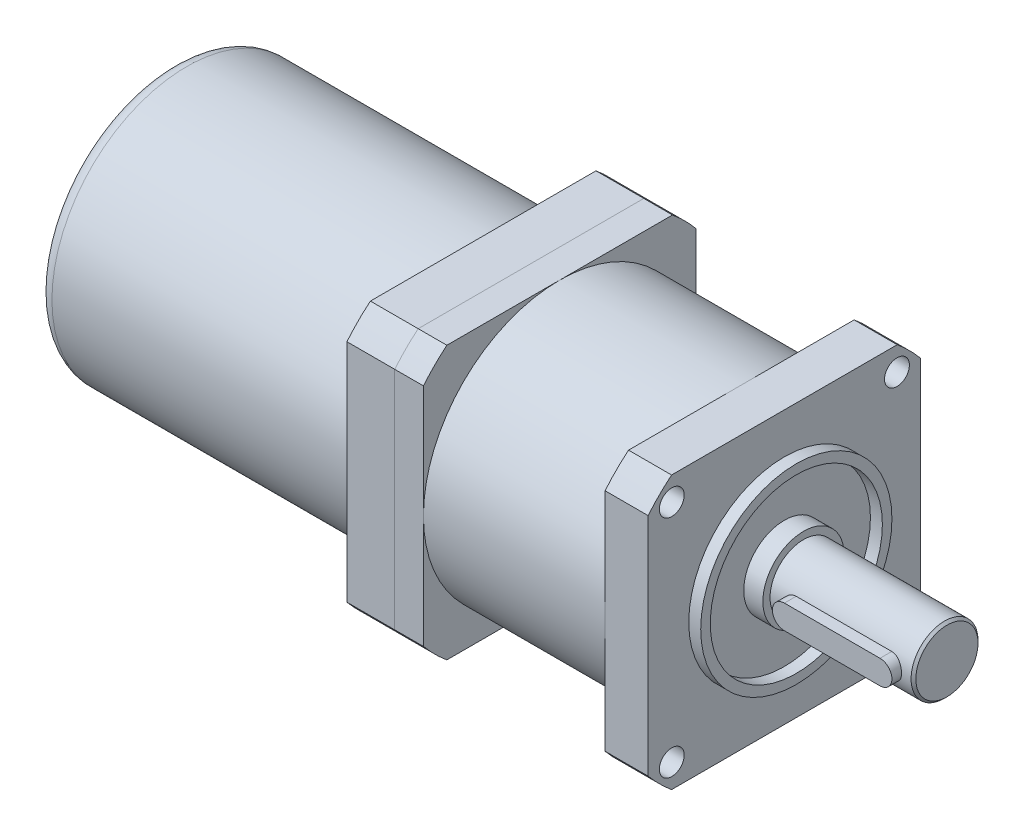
ISO-10303-21;
HEADER;
FILE_DESCRIPTION(('STEP AP214'),'2;1');
FILE_NAME('part.step','',(''),(''),'','','');
FILE_SCHEMA(('AUTOMOTIVE_DESIGN { 1 0 10303 214 1 1 1 1 }'));
ENDSEC;
DATA;
#1=APPLICATION_CONTEXT('core data for automotive mechanical design processes');
#2=APPLICATION_PROTOCOL_DEFINITION('international standard','automotive_design',2000,#1);
#3=PRODUCT_CONTEXT('',#1,'mechanical');
#4=PRODUCT('Part','Part','',(#3));
#5=PRODUCT_RELATED_PRODUCT_CATEGORY('part','',(#4));
#6=PRODUCT_DEFINITION_FORMATION('','',#4);
#7=PRODUCT_DEFINITION_CONTEXT('part definition',#1,'design');
#8=PRODUCT_DEFINITION('design','',#6,#7);
#9=PRODUCT_DEFINITION_SHAPE('','',#8);
#10=(LENGTH_UNIT() NAMED_UNIT(*) SI_UNIT(.MILLI.,.METRE.));
#11=(NAMED_UNIT(*) PLANE_ANGLE_UNIT() SI_UNIT($,.RADIAN.));
#12=(NAMED_UNIT(*) SI_UNIT($,.STERADIAN.) SOLID_ANGLE_UNIT());
#13=UNCERTAINTY_MEASURE_WITH_UNIT(LENGTH_MEASURE(1.E-05),#10,'distance_accuracy_value','');
#14=(GEOMETRIC_REPRESENTATION_CONTEXT(3) GLOBAL_UNCERTAINTY_ASSIGNED_CONTEXT((#13)) GLOBAL_UNIT_ASSIGNED_CONTEXT((#10,
#11,#12)) REPRESENTATION_CONTEXT('',''));
#15=CARTESIAN_POINT('',(0.,0.,0.));
#16=DIRECTION('',(0.,0.,1.));
#17=DIRECTION('',(1.,0.,0.));
#18=AXIS2_PLACEMENT_3D('',#15,#16,#17);
#19=CARTESIAN_POINT('',(-63.,0.,0.));
#20=DIRECTION('',(-1.,0.,0.));
#21=DIRECTION('',(0.,0.,1.));
#22=AXIS2_PLACEMENT_3D('',#19,#20,#21);
#23=PLANE('',#22);
#24=CARTESIAN_POINT('',(-63.,0.,0.));
#25=DIRECTION('',(-1.,0.,0.));
#26=DIRECTION('',(0.,0.,1.));
#27=AXIS2_PLACEMENT_3D('',#24,#25,#26);
#28=CIRCLE('',#27,37.);
#29=CARTESIAN_POINT('',(-63.,28.5,-23.5955504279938));
#30=VERTEX_POINT('',#29);
#31=CARTESIAN_POINT('',(-63.,23.5955504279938,-28.5));
#32=VERTEX_POINT('',#31);
#33=EDGE_CURVE('E158',#30,#32,#28,.T.);
#34=ORIENTED_EDGE('',*,*,#33,.T.);
#35=DIRECTION('',(0.,-1.,0.));
#36=VECTOR('',#35,1.);
#37=CARTESIAN_POINT('',(-63.,-23.5955504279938,-28.5));
#38=LINE('',#37,#36);
#39=CARTESIAN_POINT('',(-63.,-23.5955504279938,-28.5));
#40=VERTEX_POINT('',#39);
#41=EDGE_CURVE('E106',#32,#40,#38,.T.);
#42=ORIENTED_EDGE('',*,*,#41,.T.);
#43=CARTESIAN_POINT('',(-63.,0.,0.));
#44=DIRECTION('',(-1.,0.,0.));
#45=DIRECTION('',(0.,0.,1.));
#46=AXIS2_PLACEMENT_3D('',#43,#44,#45);
#47=CIRCLE('',#46,37.);
#48=CARTESIAN_POINT('',(-63.,-28.5,-23.5955504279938));
#49=VERTEX_POINT('',#48);
#50=EDGE_CURVE('E226',#40,#49,#47,.T.);
#51=ORIENTED_EDGE('',*,*,#50,.T.);
#52=DIRECTION('',(0.,0.,1.));
#53=VECTOR('',#52,1.);
#54=CARTESIAN_POINT('',(-63.,-28.5,-23.5955504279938));
#55=LINE('',#54,#53);
#56=CARTESIAN_POINT('',(-63.,-28.5,23.5955504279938));
#57=VERTEX_POINT('',#56);
#58=EDGE_CURVE('E231',#49,#57,#55,.T.);
#59=ORIENTED_EDGE('',*,*,#58,.T.);
#60=CARTESIAN_POINT('',(-63.,0.,0.));
#61=DIRECTION('',(-1.,0.,0.));
#62=DIRECTION('',(0.,0.,1.));
#63=AXIS2_PLACEMENT_3D('',#60,#61,#62);
#64=CIRCLE('',#63,37.);
#65=CARTESIAN_POINT('',(-63.,-23.5955504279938,28.5));
#66=VERTEX_POINT('',#65);
#67=EDGE_CURVE('E125',#57,#66,#64,.T.);
#68=ORIENTED_EDGE('',*,*,#67,.T.);
#69=DIRECTION('',(0.,1.,0.));
#70=VECTOR('',#69,1.);
#71=CARTESIAN_POINT('',(-63.,-23.5955504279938,28.5));
#72=LINE('',#71,#70);
#73=CARTESIAN_POINT('',(-63.,23.5955504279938,28.5));
#74=VERTEX_POINT('',#73);
#75=EDGE_CURVE('E119',#66,#74,#72,.T.);
#76=ORIENTED_EDGE('',*,*,#75,.T.);
#77=CARTESIAN_POINT('',(-63.,0.,0.));
#78=DIRECTION('',(-1.,0.,0.));
#79=DIRECTION('',(0.,0.,1.));
#80=AXIS2_PLACEMENT_3D('',#77,#78,#79);
#81=CIRCLE('',#80,37.);
#82=CARTESIAN_POINT('',(-63.,28.5,23.5955504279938));
#83=VERTEX_POINT('',#82);
#84=EDGE_CURVE('E123',#74,#83,#81,.T.);
#85=ORIENTED_EDGE('',*,*,#84,.T.);
#86=DIRECTION('',(0.,0.,-1.));
#87=VECTOR('',#86,1.);
#88=CARTESIAN_POINT('',(-63.,28.5,-23.5955504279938));
#89=LINE('',#88,#87);
#90=EDGE_CURVE('E62',#83,#30,#89,.T.);
#91=ORIENTED_EDGE('',*,*,#90,.T.);
#92=EDGE_LOOP('',(#34,#42,#51,#59,#68,#76,#85,#91));
#93=FACE_BOUND('',#92,.T.);
#94=CARTESIAN_POINT('',(-63.,0.,0.));
#95=DIRECTION('',(-1.,0.,0.));
#96=DIRECTION('',(0.,0.,1.));
#97=AXIS2_PLACEMENT_3D('',#94,#95,#96);
#98=CIRCLE('',#97,28.2);
#99=CARTESIAN_POINT('',(-63.,0.,28.2));
#100=VERTEX_POINT('',#99);
#101=EDGE_CURVE('E147',#100,#100,#98,.T.);
#102=ORIENTED_EDGE('',*,*,#101,.F.);
#103=EDGE_LOOP('',(#102));
#104=FACE_BOUND('',#103,.T.);
#105=ADVANCED_FACE('F45',(#93,#104),#23,.T.);
#106=CARTESIAN_POINT('',(-63.,0.,0.));
#107=DIRECTION('',(1.,0.,0.));
#108=DIRECTION('',(0.,0.,-1.));
#109=AXIS2_PLACEMENT_3D('',#106,#107,#108);
#110=CYLINDRICAL_SURFACE('',#109,37.);
#111=CARTESIAN_POINT('',(-53.,0.,0.));
#112=DIRECTION('',(-1.,0.,0.));
#113=DIRECTION('',(0.,0.,1.));
#114=AXIS2_PLACEMENT_3D('',#111,#112,#113);
#115=CIRCLE('',#114,37.);
#116=CARTESIAN_POINT('',(-53.,28.5,-23.5955504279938));
#117=VERTEX_POINT('',#116);
#118=CARTESIAN_POINT('',(-53.,23.5955504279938,-28.5));
#119=VERTEX_POINT('',#118);
#120=EDGE_CURVE('E143',#117,#119,#115,.T.);
#121=ORIENTED_EDGE('',*,*,#120,.T.);
#122=DIRECTION('',(1.,0.,0.));
#123=VECTOR('',#122,1.);
#124=CARTESIAN_POINT('',(-63.,23.5955504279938,-28.5));
#125=LINE('',#124,#123);
#126=EDGE_CURVE('E171',#32,#119,#125,.T.);
#127=ORIENTED_EDGE('',*,*,#126,.F.);
#128=ORIENTED_EDGE('',*,*,#33,.F.);
#129=DIRECTION('',(1.,0.,0.));
#130=VECTOR('',#129,1.);
#131=CARTESIAN_POINT('',(-63.,28.5,-23.5955504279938));
#132=LINE('',#131,#130);
#133=EDGE_CURVE('E139',#30,#117,#132,.T.);
#134=ORIENTED_EDGE('',*,*,#133,.T.);
#135=EDGE_LOOP('',(#121,#127,#128,#134));
#136=FACE_BOUND('',#135,.T.);
#137=ADVANCED_FACE('F186',(#136),#110,.T.);
#138=CARTESIAN_POINT('',(-63.,-23.5955504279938,-28.5));
#139=DIRECTION('',(0.,0.,1.));
#140=DIRECTION('',(1.,0.,0.));
#141=AXIS2_PLACEMENT_3D('',#138,#139,#140);
#142=PLANE('',#141);
#143=DIRECTION('',(0.,-1.,0.));
#144=VECTOR('',#143,1.);
#145=CARTESIAN_POINT('',(-53.,-23.5955504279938,-28.5));
#146=LINE('',#145,#144);
#147=CARTESIAN_POINT('',(-53.,-23.5955504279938,-28.5));
#148=VERTEX_POINT('',#147);
#149=EDGE_CURVE('E146',#119,#148,#146,.T.);
#150=ORIENTED_EDGE('',*,*,#149,.T.);
#151=DIRECTION('',(1.,0.,0.));
#152=VECTOR('',#151,1.);
#153=CARTESIAN_POINT('',(-63.,-23.5955504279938,-28.5));
#154=LINE('',#153,#152);
#155=EDGE_CURVE('E168',#40,#148,#154,.T.);
#156=ORIENTED_EDGE('',*,*,#155,.F.);
#157=ORIENTED_EDGE('',*,*,#41,.F.);
#158=ORIENTED_EDGE('',*,*,#126,.T.);
#159=EDGE_LOOP('',(#150,#156,#157,#158));
#160=FACE_BOUND('',#159,.T.);
#161=ADVANCED_FACE('F191',(#160),#142,.F.);
#162=CARTESIAN_POINT('',(-63.,0.,0.));
#163=DIRECTION('',(1.,0.,0.));
#164=DIRECTION('',(0.,0.,-1.));
#165=AXIS2_PLACEMENT_3D('',#162,#163,#164);
#166=CYLINDRICAL_SURFACE('',#165,37.);
#167=CARTESIAN_POINT('',(-53.,0.,0.));
#168=DIRECTION('',(-1.,0.,0.));
#169=DIRECTION('',(0.,0.,1.));
#170=AXIS2_PLACEMENT_3D('',#167,#168,#169);
#171=CIRCLE('',#170,37.);
#172=CARTESIAN_POINT('',(-53.,-28.5,-23.5955504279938));
#173=VERTEX_POINT('',#172);
#174=EDGE_CURVE('E149',#148,#173,#171,.T.);
#175=ORIENTED_EDGE('',*,*,#174,.T.);
#176=DIRECTION('',(1.,0.,0.));
#177=VECTOR('',#176,1.);
#178=CARTESIAN_POINT('',(-63.,-28.5,-23.5955504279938));
#179=LINE('',#178,#177);
#180=EDGE_CURVE('E165',#49,#173,#179,.T.);
#181=ORIENTED_EDGE('',*,*,#180,.F.);
#182=ORIENTED_EDGE('',*,*,#50,.F.);
#183=ORIENTED_EDGE('',*,*,#155,.T.);
#184=EDGE_LOOP('',(#175,#181,#182,#183));
#185=FACE_BOUND('',#184,.T.);
#186=ADVANCED_FACE('F213',(#185),#166,.T.);
#187=CARTESIAN_POINT('',(-63.,-28.5,-23.5955504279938));
#188=DIRECTION('',(0.,1.,0.));
#189=DIRECTION('',(0.,0.,1.));
#190=AXIS2_PLACEMENT_3D('',#187,#188,#189);
#191=PLANE('',#190);
#192=DIRECTION('',(0.,0.,1.));
#193=VECTOR('',#192,1.);
#194=CARTESIAN_POINT('',(-53.,-28.5,-23.5955504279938));
#195=LINE('',#194,#193);
#196=CARTESIAN_POINT('',(-53.,-28.5,23.5955504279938));
#197=VERTEX_POINT('',#196);
#198=EDGE_CURVE('E151',#173,#197,#195,.T.);
#199=ORIENTED_EDGE('',*,*,#198,.T.);
#200=DIRECTION('',(1.,0.,0.));
#201=VECTOR('',#200,1.);
#202=CARTESIAN_POINT('',(-63.,-28.5,23.5955504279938));
#203=LINE('',#202,#201);
#204=EDGE_CURVE('E162',#57,#197,#203,.T.);
#205=ORIENTED_EDGE('',*,*,#204,.F.);
#206=ORIENTED_EDGE('',*,*,#58,.F.);
#207=ORIENTED_EDGE('',*,*,#180,.T.);
#208=EDGE_LOOP('',(#199,#205,#206,#207));
#209=FACE_BOUND('',#208,.T.);
#210=ADVANCED_FACE('F209',(#209),#191,.F.);
#211=CARTESIAN_POINT('',(-63.,0.,0.));
#212=DIRECTION('',(1.,0.,0.));
#213=DIRECTION('',(0.,0.,-1.));
#214=AXIS2_PLACEMENT_3D('',#211,#212,#213);
#215=CYLINDRICAL_SURFACE('',#214,37.);
#216=CARTESIAN_POINT('',(-53.,0.,0.));
#217=DIRECTION('',(-1.,0.,0.));
#218=DIRECTION('',(0.,0.,1.));
#219=AXIS2_PLACEMENT_3D('',#216,#217,#218);
#220=CIRCLE('',#219,37.);
#221=CARTESIAN_POINT('',(-53.,-23.5955504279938,28.5));
#222=VERTEX_POINT('',#221);
#223=EDGE_CURVE('E153',#197,#222,#220,.T.);
#224=ORIENTED_EDGE('',*,*,#223,.T.);
#225=DIRECTION('',(1.,0.,0.));
#226=VECTOR('',#225,1.);
#227=CARTESIAN_POINT('',(-63.,-23.5955504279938,28.5));
#228=LINE('',#227,#226);
#229=EDGE_CURVE('E134',#66,#222,#228,.T.);
#230=ORIENTED_EDGE('',*,*,#229,.F.);
#231=ORIENTED_EDGE('',*,*,#67,.F.);
#232=ORIENTED_EDGE('',*,*,#204,.T.);
#233=EDGE_LOOP('',(#224,#230,#231,#232));
#234=FACE_BOUND('',#233,.T.);
#235=ADVANCED_FACE('F206',(#234),#215,.T.);
#236=CARTESIAN_POINT('',(-63.,-23.5955504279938,28.5));
#237=DIRECTION('',(0.,0.,-1.));
#238=DIRECTION('',(-1.,0.,0.));
#239=AXIS2_PLACEMENT_3D('',#236,#237,#238);
#240=PLANE('',#239);
#241=DIRECTION('',(0.,1.,0.));
#242=VECTOR('',#241,1.);
#243=CARTESIAN_POINT('',(-53.,-23.5955504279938,28.5));
#244=LINE('',#243,#242);
#245=CARTESIAN_POINT('',(-53.,23.5955504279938,28.5));
#246=VERTEX_POINT('',#245);
#247=EDGE_CURVE('E133',#222,#246,#244,.T.);
#248=ORIENTED_EDGE('',*,*,#247,.T.);
#249=DIRECTION('',(1.,0.,0.));
#250=VECTOR('',#249,1.);
#251=CARTESIAN_POINT('',(-63.,23.5955504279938,28.5));
#252=LINE('',#251,#250);
#253=EDGE_CURVE('E130',#74,#246,#252,.T.);
#254=ORIENTED_EDGE('',*,*,#253,.F.);
#255=ORIENTED_EDGE('',*,*,#75,.F.);
#256=ORIENTED_EDGE('',*,*,#229,.T.);
#257=EDGE_LOOP('',(#248,#254,#255,#256));
#258=FACE_BOUND('',#257,.T.);
#259=ADVANCED_FACE('F131',(#258),#240,.F.);
#260=CARTESIAN_POINT('',(-63.,0.,0.));
#261=DIRECTION('',(1.,0.,0.));
#262=DIRECTION('',(0.,0.,-1.));
#263=AXIS2_PLACEMENT_3D('',#260,#261,#262);
#264=CYLINDRICAL_SURFACE('',#263,37.);
#265=CARTESIAN_POINT('',(-53.,0.,0.));
#266=DIRECTION('',(-1.,0.,0.));
#267=DIRECTION('',(0.,0.,1.));
#268=AXIS2_PLACEMENT_3D('',#265,#266,#267);
#269=CIRCLE('',#268,37.);
#270=CARTESIAN_POINT('',(-53.,28.5,23.5955504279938));
#271=VERTEX_POINT('',#270);
#272=EDGE_CURVE('E91',#246,#271,#269,.T.);
#273=ORIENTED_EDGE('',*,*,#272,.T.);
#274=DIRECTION('',(1.,0.,0.));
#275=VECTOR('',#274,1.);
#276=CARTESIAN_POINT('',(-63.,28.5,23.5955504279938));
#277=LINE('',#276,#275);
#278=EDGE_CURVE('E135',#83,#271,#277,.T.);
#279=ORIENTED_EDGE('',*,*,#278,.F.);
#280=ORIENTED_EDGE('',*,*,#84,.F.);
#281=ORIENTED_EDGE('',*,*,#253,.T.);
#282=EDGE_LOOP('',(#273,#279,#280,#281));
#283=FACE_BOUND('',#282,.T.);
#284=ADVANCED_FACE('F137',(#283),#264,.T.);
#285=CARTESIAN_POINT('',(-63.,28.5,-23.5955504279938));
#286=DIRECTION('',(0.,-1.,0.));
#287=DIRECTION('',(0.,0.,-1.));
#288=AXIS2_PLACEMENT_3D('',#285,#286,#287);
#289=PLANE('',#288);
#290=DIRECTION('',(0.,0.,-1.));
#291=VECTOR('',#290,1.);
#292=CARTESIAN_POINT('',(-53.,28.5,-23.5955504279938));
#293=LINE('',#292,#291);
#294=EDGE_CURVE('E97',#271,#117,#293,.T.);
#295=ORIENTED_EDGE('',*,*,#294,.T.);
#296=ORIENTED_EDGE('',*,*,#133,.F.);
#297=ORIENTED_EDGE('',*,*,#90,.F.);
#298=ORIENTED_EDGE('',*,*,#278,.T.);
#299=EDGE_LOOP('',(#295,#296,#297,#298));
#300=FACE_BOUND('',#299,.T.);
#301=ADVANCED_FACE('F198',(#300),#289,.F.);
#302=CARTESIAN_POINT('',(-53.,0.,0.));
#303=DIRECTION('',(-1.,0.,0.));
#304=DIRECTION('',(0.,0.,1.));
#305=AXIS2_PLACEMENT_3D('',#302,#303,#304);
#306=PLANE('',#305);
#307=ORIENTED_EDGE('',*,*,#120,.F.);
#308=ORIENTED_EDGE('',*,*,#294,.F.);
#309=ORIENTED_EDGE('',*,*,#272,.F.);
#310=ORIENTED_EDGE('',*,*,#247,.F.);
#311=ORIENTED_EDGE('',*,*,#223,.F.);
#312=ORIENTED_EDGE('',*,*,#198,.F.);
#313=ORIENTED_EDGE('',*,*,#174,.F.);
#314=ORIENTED_EDGE('',*,*,#149,.F.);
#315=EDGE_LOOP('',(#307,#308,#309,#310,#311,#312,#313,#314));
#316=FACE_BOUND('',#315,.T.);
#317=ADVANCED_FACE('F195',(#316),#306,.F.);
#318=CARTESIAN_POINT('',(-128.,0.,0.));
#319=DIRECTION('',(1.,0.,0.));
#320=DIRECTION('',(0.,0.,-1.));
#321=AXIS2_PLACEMENT_3D('',#318,#319,#320);
#322=CYLINDRICAL_SURFACE('',#321,28.2);
#323=CARTESIAN_POINT('',(-125.,0.,0.));
#324=DIRECTION('',(-1.,0.,0.));
#325=DIRECTION('',(0.,0.,1.));
#326=AXIS2_PLACEMENT_3D('',#323,#324,#325);
#327=CIRCLE('',#326,28.2);
#328=CARTESIAN_POINT('',(-125.,0.,28.2));
#329=VERTEX_POINT('',#328);
#330=EDGE_CURVE('E12',#329,#329,#327,.F.);
#331=ORIENTED_EDGE('',*,*,#330,.T.);
#332=EDGE_LOOP('',(#331));
#333=FACE_BOUND('',#332,.T.);
#334=ORIENTED_EDGE('',*,*,#101,.T.);
#335=EDGE_LOOP('',(#334));
#336=FACE_BOUND('',#335,.T.);
#337=ADVANCED_FACE('F182',(#333,#336),#322,.T.);
#338=CARTESIAN_POINT('',(-128.,0.,0.));
#339=DIRECTION('',(-1.,0.,0.));
#340=DIRECTION('',(0.,0.,1.));
#341=AXIS2_PLACEMENT_3D('',#338,#339,#340);
#342=PLANE('',#341);
#343=CARTESIAN_POINT('',(-128.,0.,0.));
#344=DIRECTION('',(-1.,0.,0.));
#345=DIRECTION('',(0.,0.,1.));
#346=AXIS2_PLACEMENT_3D('',#343,#344,#345);
#347=CIRCLE('',#346,25.2);
#348=CARTESIAN_POINT('',(-128.,0.,25.2));
#349=VERTEX_POINT('',#348);
#350=EDGE_CURVE('E54',#349,#349,#347,.T.);
#351=ORIENTED_EDGE('',*,*,#350,.T.);
#352=EDGE_LOOP('',(#351));
#353=FACE_BOUND('',#352,.T.);
#354=ADVANCED_FACE('F175',(#353),#342,.T.);
#355=CARTESIAN_POINT('',(-125.,0.,0.));
#356=DIRECTION('',(-1.,0.,0.));
#357=DIRECTION('',(0.,0.,1.));
#358=AXIS2_PLACEMENT_3D('',#355,#356,#357);
#359=TOROIDAL_SURFACE('',#358,25.2,3.);
#360=ORIENTED_EDGE('',*,*,#330,.F.);
#361=EDGE_LOOP('',(#360));
#362=FACE_BOUND('',#361,.T.);
#363=ORIENTED_EDGE('',*,*,#350,.F.);
#364=EDGE_LOOP('',(#363));
#365=FACE_BOUND('',#364,.T.);
#366=ADVANCED_FACE('F47',(#362,#365),#359,.T.);
#367=CLOSED_SHELL('',(#105,#137,#161,#186,#210,#235,#259,#284,#301,#317,#337,#354,#366));
#368=MANIFOLD_SOLID_BREP('B2',#367);
#369=CARTESIAN_POINT('',(4.,0.,0.));
#370=DIRECTION('',(1.,0.,0.));
#371=DIRECTION('',(0.,0.,-1.));
#372=AXIS2_PLACEMENT_3D('',#369,#370,#371);
#373=PLANE('',#372);
#374=CARTESIAN_POINT('',(4.,0.,0.));
#375=DIRECTION('',(1.,0.,0.));
#376=DIRECTION('',(0.,0.,-1.));
#377=AXIS2_PLACEMENT_3D('',#374,#375,#376);
#378=CIRCLE('',#377,8.5);
#379=CARTESIAN_POINT('',(4.,0.,-8.5));
#380=VERTEX_POINT('',#379);
#381=EDGE_CURVE('E510',#380,#380,#378,.T.);
#382=ORIENTED_EDGE('',*,*,#381,.T.);
#383=EDGE_LOOP('',(#382));
#384=FACE_BOUND('',#383,.T.);
#385=CARTESIAN_POINT('',(4.,0.,0.));
#386=DIRECTION('',(1.,0.,0.));
#387=DIRECTION('',(0.,0.,-1.));
#388=AXIS2_PLACEMENT_3D('',#385,#386,#387);
#389=CIRCLE('',#388,7.);
#390=CARTESIAN_POINT('',(4.,0.,-7.));
#391=VERTEX_POINT('',#390);
#392=EDGE_CURVE('E501',#391,#391,#389,.T.);
#393=ORIENTED_EDGE('',*,*,#392,.F.);
#394=EDGE_LOOP('',(#393));
#395=FACE_BOUND('',#394,.T.);
#396=ADVANCED_FACE('F318',(#384,#395),#373,.T.);
#397=CARTESIAN_POINT('',(0.,0.,0.));
#398=DIRECTION('',(1.,0.,0.));
#399=DIRECTION('',(0.,0.,-1.));
#400=AXIS2_PLACEMENT_3D('',#397,#398,#399);
#401=PLANE('',#400);
#402=CARTESIAN_POINT('',(0.,0.,0.));
#403=DIRECTION('',(1.,0.,0.));
#404=DIRECTION('',(0.,0.,-1.));
#405=AXIS2_PLACEMENT_3D('',#402,#403,#404);
#406=CIRCLE('',#405,18.);
#407=CARTESIAN_POINT('',(0.,0.,-18.));
#408=VERTEX_POINT('',#407);
#409=EDGE_CURVE('E690',#408,#408,#406,.F.);
#410=ORIENTED_EDGE('',*,*,#409,.F.);
#411=EDGE_LOOP('',(#410));
#412=FACE_BOUND('',#411,.T.);
#413=CARTESIAN_POINT('',(0.,0.,0.));
#414=DIRECTION('',(1.,0.,0.));
#415=DIRECTION('',(0.,0.,-1.));
#416=AXIS2_PLACEMENT_3D('',#413,#414,#415);
#417=CIRCLE('',#416,8.5);
#418=CARTESIAN_POINT('',(0.,0.,-8.5));
#419=VERTEX_POINT('',#418);
#420=EDGE_CURVE('E504',#419,#419,#417,.T.);
#421=ORIENTED_EDGE('',*,*,#420,.F.);
#422=EDGE_LOOP('',(#421));
#423=FACE_BOUND('',#422,.T.);
#424=ADVANCED_FACE('F725',(#412,#423),#401,.T.);
#425=CARTESIAN_POINT('',(0.,-23.55,23.55));
#426=DIRECTION('',(1.,0.,0.));
#427=DIRECTION('',(0.,0.,-1.));
#428=AXIS2_PLACEMENT_3D('',#425,#426,#427);
#429=CIRCLE('',#428,2.6);
#430=CARTESIAN_POINT('',(0.,-23.55,20.95));
#431=VERTEX_POINT('',#430);
#432=EDGE_CURVE('E522',#431,#431,#429,.T.);
#433=ORIENTED_EDGE('',*,*,#432,.F.);
#434=EDGE_LOOP('',(#433));
#435=FACE_BOUND('',#434,.T.);
#436=CARTESIAN_POINT('',(0.,-23.55,-23.55));
#437=DIRECTION('',(1.,0.,0.));
#438=DIRECTION('',(0.,0.,-1.));
#439=AXIS2_PLACEMENT_3D('',#436,#437,#438);
#440=CIRCLE('',#439,2.6);
#441=CARTESIAN_POINT('',(0.,-23.55,-26.15));
#442=VERTEX_POINT('',#441);
#443=EDGE_CURVE('E528',#442,#442,#440,.T.);
#444=ORIENTED_EDGE('',*,*,#443,.F.);
#445=EDGE_LOOP('',(#444));
#446=FACE_BOUND('',#445,.T.);
#447=CARTESIAN_POINT('',(0.,23.55,-23.55));
#448=DIRECTION('',(1.,0.,0.));
#449=DIRECTION('',(0.,0.,-1.));
#450=AXIS2_PLACEMENT_3D('',#447,#448,#449);
#451=CIRCLE('',#450,2.6);
#452=CARTESIAN_POINT('',(0.,23.55,-26.15));
#453=VERTEX_POINT('',#452);
#454=EDGE_CURVE('E534',#453,#453,#451,.T.);
#455=ORIENTED_EDGE('',*,*,#454,.F.);
#456=EDGE_LOOP('',(#455));
#457=FACE_BOUND('',#456,.T.);
#458=CARTESIAN_POINT('',(0.,23.55,23.55));
#459=DIRECTION('',(1.,0.,0.));
#460=DIRECTION('',(0.,0.,-1.));
#461=AXIS2_PLACEMENT_3D('',#458,#459,#460);
#462=CIRCLE('',#461,2.6);
#463=CARTESIAN_POINT('',(0.,23.55,20.95));
#464=VERTEX_POINT('',#463);
#465=EDGE_CURVE('E540',#464,#464,#462,.T.);
#466=ORIENTED_EDGE('',*,*,#465,.F.);
#467=EDGE_LOOP('',(#466));
#468=FACE_BOUND('',#467,.T.);
#469=CARTESIAN_POINT('',(0.,0.,0.));
#470=DIRECTION('',(1.,0.,0.));
#471=DIRECTION('',(0.,0.,-1.));
#472=AXIS2_PLACEMENT_3D('',#469,#470,#471);
#473=CIRCLE('',#472,37.);
#474=CARTESIAN_POINT('',(0.,23.5955504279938,-28.5));
#475=VERTEX_POINT('',#474);
#476=CARTESIAN_POINT('',(0.,28.5,-23.5955504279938));
#477=VERTEX_POINT('',#476);
#478=EDGE_CURVE('E618',#475,#477,#473,.T.);
#479=ORIENTED_EDGE('',*,*,#478,.T.);
#480=DIRECTION('',(0.,0.,1.));
#481=VECTOR('',#480,1.);
#482=CARTESIAN_POINT('',(0.,28.5,23.5955504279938));
#483=LINE('',#482,#481);
#484=CARTESIAN_POINT('',(0.,28.5,23.5955504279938));
#485=VERTEX_POINT('',#484);
#486=EDGE_CURVE('E655',#477,#485,#483,.T.);
#487=ORIENTED_EDGE('',*,*,#486,.T.);
#488=CARTESIAN_POINT('',(0.,0.,0.));
#489=DIRECTION('',(1.,0.,0.));
#490=DIRECTION('',(0.,0.,-1.));
#491=AXIS2_PLACEMENT_3D('',#488,#489,#490);
#492=CIRCLE('',#491,37.);
#493=CARTESIAN_POINT('',(0.,23.5955504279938,28.5));
#494=VERTEX_POINT('',#493);
#495=EDGE_CURVE('E658',#485,#494,#492,.T.);
#496=ORIENTED_EDGE('',*,*,#495,.T.);
#497=DIRECTION('',(0.,-1.,0.));
#498=VECTOR('',#497,1.);
#499=CARTESIAN_POINT('',(0.,-23.5955504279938,28.5));
#500=LINE('',#499,#498);
#501=CARTESIAN_POINT('',(0.,-23.5955504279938,28.5));
#502=VERTEX_POINT('',#501);
#503=EDGE_CURVE('E661',#494,#502,#500,.T.);
#504=ORIENTED_EDGE('',*,*,#503,.T.);
#505=CARTESIAN_POINT('',(0.,0.,0.));
#506=DIRECTION('',(1.,0.,0.));
#507=DIRECTION('',(0.,0.,-1.));
#508=AXIS2_PLACEMENT_3D('',#505,#506,#507);
#509=CIRCLE('',#508,37.);
#510=CARTESIAN_POINT('',(0.,-28.5,23.5955504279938));
#511=VERTEX_POINT('',#510);
#512=EDGE_CURVE('E664',#502,#511,#509,.T.);
#513=ORIENTED_EDGE('',*,*,#512,.T.);
#514=DIRECTION('',(0.,0.,-1.));
#515=VECTOR('',#514,1.);
#516=CARTESIAN_POINT('',(0.,-28.5,23.5955504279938));
#517=LINE('',#516,#515);
#518=CARTESIAN_POINT('',(0.,-28.5,-23.5955504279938));
#519=VERTEX_POINT('',#518);
#520=EDGE_CURVE('E667',#511,#519,#517,.T.);
#521=ORIENTED_EDGE('',*,*,#520,.T.);
#522=CARTESIAN_POINT('',(0.,0.,0.));
#523=DIRECTION('',(1.,0.,0.));
#524=DIRECTION('',(0.,0.,-1.));
#525=AXIS2_PLACEMENT_3D('',#522,#523,#524);
#526=CIRCLE('',#525,37.);
#527=CARTESIAN_POINT('',(0.,-23.5955504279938,-28.5));
#528=VERTEX_POINT('',#527);
#529=EDGE_CURVE('E670',#519,#528,#526,.T.);
#530=ORIENTED_EDGE('',*,*,#529,.T.);
#531=DIRECTION('',(0.,1.,0.));
#532=VECTOR('',#531,1.);
#533=CARTESIAN_POINT('',(0.,-23.5955504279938,-28.5));
#534=LINE('',#533,#532);
#535=EDGE_CURVE('E628',#528,#475,#534,.T.);
#536=ORIENTED_EDGE('',*,*,#535,.T.);
#537=EDGE_LOOP('',(#479,#487,#496,#504,#513,#521,#530,#536));
#538=FACE_BOUND('',#537,.T.);
#539=CARTESIAN_POINT('',(0.,0.,0.));
#540=DIRECTION('',(1.,0.,0.));
#541=DIRECTION('',(0.,0.,-1.));
#542=AXIS2_PLACEMENT_3D('',#539,#540,#541);
#543=CIRCLE('',#542,20.);
#544=CARTESIAN_POINT('',(0.,0.,-20.));
#545=VERTEX_POINT('',#544);
#546=EDGE_CURVE('E518',#545,#545,#543,.T.);
#547=ORIENTED_EDGE('',*,*,#546,.F.);
#548=EDGE_LOOP('',(#547));
#549=FACE_BOUND('',#548,.T.);
#550=ADVANCED_FACE('F730',(#435,#446,#457,#468,#538,#549),#401,.T.);
#551=CARTESIAN_POINT('',(-9.,0.,0.));
#552=DIRECTION('',(1.,0.,0.));
#553=DIRECTION('',(0.,0.,-1.));
#554=AXIS2_PLACEMENT_3D('',#551,#552,#553);
#555=PLANE('',#554);
#556=CARTESIAN_POINT('',(-9.,23.55,23.55));
#557=DIRECTION('',(1.,0.,0.));
#558=DIRECTION('',(0.,0.,-1.));
#559=AXIS2_PLACEMENT_3D('',#556,#557,#558);
#560=CIRCLE('',#559,2.6);
#561=CARTESIAN_POINT('',(-9.,23.55,20.95));
#562=VERTEX_POINT('',#561);
#563=EDGE_CURVE('E543',#562,#562,#560,.T.);
#564=ORIENTED_EDGE('',*,*,#563,.T.);
#565=EDGE_LOOP('',(#564));
#566=FACE_BOUND('',#565,.T.);
#567=CARTESIAN_POINT('',(-9.,0.,0.));
#568=DIRECTION('',(-1.,0.,0.));
#569=DIRECTION('',(0.,0.,1.));
#570=AXIS2_PLACEMENT_3D('',#567,#568,#569);
#571=CIRCLE('',#570,28.5);
#572=CARTESIAN_POINT('',(-9.,0.,28.5));
#573=VERTEX_POINT('',#572);
#574=CARTESIAN_POINT('',(-9.,28.5,0.));
#575=VERTEX_POINT('',#574);
#576=EDGE_CURVE('E614',#573,#575,#571,.T.);
#577=ORIENTED_EDGE('',*,*,#576,.F.);
#578=DIRECTION('',(0.,-1.,0.));
#579=VECTOR('',#578,1.);
#580=CARTESIAN_POINT('',(-9.,-23.5955504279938,28.5));
#581=LINE('',#580,#579);
#582=CARTESIAN_POINT('',(-9.,23.5955504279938,28.5));
#583=VERTEX_POINT('',#582);
#584=EDGE_CURVE('E636',#583,#573,#581,.T.);
#585=ORIENTED_EDGE('',*,*,#584,.F.);
#586=CARTESIAN_POINT('',(-9.,0.,0.));
#587=DIRECTION('',(1.,0.,0.));
#588=DIRECTION('',(0.,0.,-1.));
#589=AXIS2_PLACEMENT_3D('',#586,#587,#588);
#590=CIRCLE('',#589,37.);
#591=CARTESIAN_POINT('',(-9.,28.5,23.5955504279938));
#592=VERTEX_POINT('',#591);
#593=EDGE_CURVE('E632',#592,#583,#590,.T.);
#594=ORIENTED_EDGE('',*,*,#593,.F.);
#595=DIRECTION('',(0.,0.,1.));
#596=VECTOR('',#595,1.);
#597=CARTESIAN_POINT('',(-9.,28.5,23.5955504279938));
#598=LINE('',#597,#596);
#599=EDGE_CURVE('E627',#575,#592,#598,.T.);
#600=ORIENTED_EDGE('',*,*,#599,.F.);
#601=EDGE_LOOP('',(#577,#585,#594,#600));
#602=FACE_BOUND('',#601,.T.);
#603=ADVANCED_FACE('F812',(#566,#602),#555,.F.);
#604=CARTESIAN_POINT('',(-9.,23.55,-23.55));
#605=DIRECTION('',(1.,0.,0.));
#606=DIRECTION('',(0.,0.,-1.));
#607=AXIS2_PLACEMENT_3D('',#604,#605,#606);
#608=CIRCLE('',#607,2.6);
#609=CARTESIAN_POINT('',(-9.,23.55,-26.15));
#610=VERTEX_POINT('',#609);
#611=EDGE_CURVE('E537',#610,#610,#608,.T.);
#612=ORIENTED_EDGE('',*,*,#611,.T.);
#613=EDGE_LOOP('',(#612));
#614=FACE_BOUND('',#613,.T.);
#615=CARTESIAN_POINT('',(-9.,0.,-28.5));
#616=VERTEX_POINT('',#615);
#617=EDGE_CURVE('E622',#575,#616,#571,.T.);
#618=ORIENTED_EDGE('',*,*,#617,.F.);
#619=CARTESIAN_POINT('',(-9.,28.5,-23.5955504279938));
#620=VERTEX_POINT('',#619);
#621=EDGE_CURVE('E629',#620,#575,#598,.T.);
#622=ORIENTED_EDGE('',*,*,#621,.F.);
#623=CARTESIAN_POINT('',(-9.,0.,0.));
#624=DIRECTION('',(1.,0.,0.));
#625=DIRECTION('',(0.,0.,-1.));
#626=AXIS2_PLACEMENT_3D('',#623,#624,#625);
#627=CIRCLE('',#626,37.);
#628=CARTESIAN_POINT('',(-9.,23.5955504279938,-28.5));
#629=VERTEX_POINT('',#628);
#630=EDGE_CURVE('E624',#629,#620,#627,.T.);
#631=ORIENTED_EDGE('',*,*,#630,.F.);
#632=DIRECTION('',(0.,1.,0.));
#633=VECTOR('',#632,1.);
#634=CARTESIAN_POINT('',(-9.,-23.5955504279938,-28.5));
#635=LINE('',#634,#633);
#636=EDGE_CURVE('E648',#616,#629,#635,.T.);
#637=ORIENTED_EDGE('',*,*,#636,.F.);
#638=EDGE_LOOP('',(#618,#622,#631,#637));
#639=FACE_BOUND('',#638,.T.);
#640=ADVANCED_FACE('F814',(#614,#639),#555,.F.);
#641=CARTESIAN_POINT('',(-9.,-23.55,-23.55));
#642=DIRECTION('',(1.,0.,0.));
#643=DIRECTION('',(0.,0.,-1.));
#644=AXIS2_PLACEMENT_3D('',#641,#642,#643);
#645=CIRCLE('',#644,2.6);
#646=CARTESIAN_POINT('',(-9.,-23.55,-26.15));
#647=VERTEX_POINT('',#646);
#648=EDGE_CURVE('E531',#647,#647,#645,.T.);
#649=ORIENTED_EDGE('',*,*,#648,.T.);
#650=EDGE_LOOP('',(#649));
#651=FACE_BOUND('',#650,.T.);
#652=CARTESIAN_POINT('',(-9.,-28.5,0.));
#653=VERTEX_POINT('',#652);
#654=EDGE_CURVE('E886',#616,#653,#571,.T.);
#655=ORIENTED_EDGE('',*,*,#654,.F.);
#656=CARTESIAN_POINT('',(-9.,-23.5955504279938,-28.5));
#657=VERTEX_POINT('',#656);
#658=EDGE_CURVE('E649',#657,#616,#635,.T.);
#659=ORIENTED_EDGE('',*,*,#658,.F.);
#660=CARTESIAN_POINT('',(-9.,0.,0.));
#661=DIRECTION('',(1.,0.,0.));
#662=DIRECTION('',(0.,0.,-1.));
#663=AXIS2_PLACEMENT_3D('',#660,#661,#662);
#664=CIRCLE('',#663,37.);
#665=CARTESIAN_POINT('',(-9.,-28.5,-23.5955504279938));
#666=VERTEX_POINT('',#665);
#667=EDGE_CURVE('E645',#666,#657,#664,.T.);
#668=ORIENTED_EDGE('',*,*,#667,.F.);
#669=DIRECTION('',(0.,0.,-1.));
#670=VECTOR('',#669,1.);
#671=CARTESIAN_POINT('',(-9.,-28.5,23.5955504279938));
#672=LINE('',#671,#670);
#673=EDGE_CURVE('E641',#653,#666,#672,.T.);
#674=ORIENTED_EDGE('',*,*,#673,.F.);
#675=EDGE_LOOP('',(#655,#659,#668,#674));
#676=FACE_BOUND('',#675,.T.);
#677=ADVANCED_FACE('F850',(#651,#676),#555,.F.);
#678=CARTESIAN_POINT('',(-9.,-23.55,23.55));
#679=DIRECTION('',(1.,0.,0.));
#680=DIRECTION('',(0.,0.,-1.));
#681=AXIS2_PLACEMENT_3D('',#678,#679,#680);
#682=CIRCLE('',#681,2.6);
#683=CARTESIAN_POINT('',(-9.,-23.55,20.95));
#684=VERTEX_POINT('',#683);
#685=EDGE_CURVE('E525',#684,#684,#682,.T.);
#686=ORIENTED_EDGE('',*,*,#685,.T.);
#687=EDGE_LOOP('',(#686));
#688=FACE_BOUND('',#687,.T.);
#689=EDGE_CURVE('E623',#653,#573,#571,.T.);
#690=ORIENTED_EDGE('',*,*,#689,.F.);
#691=CARTESIAN_POINT('',(-9.,-28.5,23.5955504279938));
#692=VERTEX_POINT('',#691);
#693=EDGE_CURVE('E642',#692,#653,#672,.T.);
#694=ORIENTED_EDGE('',*,*,#693,.F.);
#695=CARTESIAN_POINT('',(-9.,0.,0.));
#696=DIRECTION('',(1.,0.,0.));
#697=DIRECTION('',(0.,0.,-1.));
#698=AXIS2_PLACEMENT_3D('',#695,#696,#697);
#699=CIRCLE('',#698,37.);
#700=CARTESIAN_POINT('',(-9.,-23.5955504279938,28.5));
#701=VERTEX_POINT('',#700);
#702=EDGE_CURVE('E638',#701,#692,#699,.T.);
#703=ORIENTED_EDGE('',*,*,#702,.F.);
#704=EDGE_CURVE('E635',#573,#701,#581,.T.);
#705=ORIENTED_EDGE('',*,*,#704,.F.);
#706=EDGE_LOOP('',(#690,#694,#703,#705));
#707=FACE_BOUND('',#706,.T.);
#708=ADVANCED_FACE('F816',(#688,#707),#555,.F.);
#709=CARTESIAN_POINT('',(-9.,0.,0.));
#710=DIRECTION('',(1.,0.,0.));
#711=DIRECTION('',(0.,0.,-1.));
#712=AXIS2_PLACEMENT_3D('',#709,#710,#711);
#713=CYLINDRICAL_SURFACE('',#712,37.);
#714=ORIENTED_EDGE('',*,*,#478,.F.);
#715=DIRECTION('',(1.,0.,0.));
#716=VECTOR('',#715,1.);
#717=CARTESIAN_POINT('',(-9.,23.5955504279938,-28.5));
#718=LINE('',#717,#716);
#719=EDGE_CURVE('E675',#629,#475,#718,.T.);
#720=ORIENTED_EDGE('',*,*,#719,.F.);
#721=ORIENTED_EDGE('',*,*,#630,.T.);
#722=DIRECTION('',(1.,0.,0.));
#723=VECTOR('',#722,1.);
#724=CARTESIAN_POINT('',(-9.,28.5,-23.5955504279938));
#725=LINE('',#724,#723);
#726=EDGE_CURVE('E652',#620,#477,#725,.T.);
#727=ORIENTED_EDGE('',*,*,#726,.T.);
#728=EDGE_LOOP('',(#714,#720,#721,#727));
#729=FACE_BOUND('',#728,.T.);
#730=ADVANCED_FACE('F822',(#729),#713,.T.);
#731=CARTESIAN_POINT('',(-9.,-23.5955504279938,-28.5));
#732=DIRECTION('',(0.,0.,-1.));
#733=DIRECTION('',(-1.,0.,0.));
#734=AXIS2_PLACEMENT_3D('',#731,#732,#733);
#735=PLANE('',#734);
#736=ORIENTED_EDGE('',*,*,#535,.F.);
#737=DIRECTION('',(1.,0.,0.));
#738=VECTOR('',#737,1.);
#739=CARTESIAN_POINT('',(-9.,-23.5955504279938,-28.5));
#740=LINE('',#739,#738);
#741=EDGE_CURVE('E677',#657,#528,#740,.T.);
#742=ORIENTED_EDGE('',*,*,#741,.F.);
#743=ORIENTED_EDGE('',*,*,#658,.T.);
#744=ORIENTED_EDGE('',*,*,#636,.T.);
#745=ORIENTED_EDGE('',*,*,#719,.T.);
#746=EDGE_LOOP('',(#736,#742,#743,#744,#745));
#747=FACE_BOUND('',#746,.T.);
#748=ADVANCED_FACE('F818',(#747),#735,.T.);
#749=CARTESIAN_POINT('',(-9.,0.,0.));
#750=DIRECTION('',(1.,0.,0.));
#751=DIRECTION('',(0.,0.,-1.));
#752=AXIS2_PLACEMENT_3D('',#749,#750,#751);
#753=CYLINDRICAL_SURFACE('',#752,37.);
#754=ORIENTED_EDGE('',*,*,#529,.F.);
#755=DIRECTION('',(1.,0.,0.));
#756=VECTOR('',#755,1.);
#757=CARTESIAN_POINT('',(-9.,-28.5,-23.5955504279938));
#758=LINE('',#757,#756);
#759=EDGE_CURVE('E679',#666,#519,#758,.T.);
#760=ORIENTED_EDGE('',*,*,#759,.F.);
#761=ORIENTED_EDGE('',*,*,#667,.T.);
#762=ORIENTED_EDGE('',*,*,#741,.T.);
#763=EDGE_LOOP('',(#754,#760,#761,#762));
#764=FACE_BOUND('',#763,.T.);
#765=ADVANCED_FACE('F821',(#764),#753,.T.);
#766=CARTESIAN_POINT('',(-9.,-28.5,23.5955504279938));
#767=DIRECTION('',(0.,-1.,0.));
#768=DIRECTION('',(0.,0.,-1.));
#769=AXIS2_PLACEMENT_3D('',#766,#767,#768);
#770=PLANE('',#769);
#771=ORIENTED_EDGE('',*,*,#520,.F.);
#772=DIRECTION('',(1.,0.,0.));
#773=VECTOR('',#772,1.);
#774=CARTESIAN_POINT('',(-9.,-28.5,23.5955504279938));
#775=LINE('',#774,#773);
#776=EDGE_CURVE('E681',#692,#511,#775,.T.);
#777=ORIENTED_EDGE('',*,*,#776,.F.);
#778=ORIENTED_EDGE('',*,*,#693,.T.);
#779=ORIENTED_EDGE('',*,*,#673,.T.);
#780=ORIENTED_EDGE('',*,*,#759,.T.);
#781=EDGE_LOOP('',(#771,#777,#778,#779,#780));
#782=FACE_BOUND('',#781,.T.);
#783=ADVANCED_FACE('F826',(#782),#770,.T.);
#784=CARTESIAN_POINT('',(-9.,0.,0.));
#785=DIRECTION('',(1.,0.,0.));
#786=DIRECTION('',(0.,0.,-1.));
#787=AXIS2_PLACEMENT_3D('',#784,#785,#786);
#788=CYLINDRICAL_SURFACE('',#787,37.);
#789=ORIENTED_EDGE('',*,*,#512,.F.);
#790=DIRECTION('',(1.,0.,0.));
#791=VECTOR('',#790,1.);
#792=CARTESIAN_POINT('',(-9.,-23.5955504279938,28.5));
#793=LINE('',#792,#791);
#794=EDGE_CURVE('E683',#701,#502,#793,.T.);
#795=ORIENTED_EDGE('',*,*,#794,.F.);
#796=ORIENTED_EDGE('',*,*,#702,.T.);
#797=ORIENTED_EDGE('',*,*,#776,.T.);
#798=EDGE_LOOP('',(#789,#795,#796,#797));
#799=FACE_BOUND('',#798,.T.);
#800=ADVANCED_FACE('F830',(#799),#788,.T.);
#801=CARTESIAN_POINT('',(-9.,-23.5955504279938,28.5));
#802=DIRECTION('',(0.,0.,1.));
#803=DIRECTION('',(1.,0.,0.));
#804=AXIS2_PLACEMENT_3D('',#801,#802,#803);
#805=PLANE('',#804);
#806=ORIENTED_EDGE('',*,*,#503,.F.);
#807=DIRECTION('',(1.,0.,0.));
#808=VECTOR('',#807,1.);
#809=CARTESIAN_POINT('',(-9.,23.5955504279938,28.5));
#810=LINE('',#809,#808);
#811=EDGE_CURVE('E685',#583,#494,#810,.T.);
#812=ORIENTED_EDGE('',*,*,#811,.F.);
#813=ORIENTED_EDGE('',*,*,#584,.T.);
#814=ORIENTED_EDGE('',*,*,#704,.T.);
#815=ORIENTED_EDGE('',*,*,#794,.T.);
#816=EDGE_LOOP('',(#806,#812,#813,#814,#815));
#817=FACE_BOUND('',#816,.T.);
#818=ADVANCED_FACE('F834',(#817),#805,.T.);
#819=CARTESIAN_POINT('',(-9.,0.,0.));
#820=DIRECTION('',(1.,0.,0.));
#821=DIRECTION('',(0.,0.,-1.));
#822=AXIS2_PLACEMENT_3D('',#819,#820,#821);
#823=CYLINDRICAL_SURFACE('',#822,37.);
#824=ORIENTED_EDGE('',*,*,#495,.F.);
#825=DIRECTION('',(1.,0.,0.));
#826=VECTOR('',#825,1.);
#827=CARTESIAN_POINT('',(-9.,28.5,23.5955504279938));
#828=LINE('',#827,#826);
#829=EDGE_CURVE('E687',#592,#485,#828,.T.);
#830=ORIENTED_EDGE('',*,*,#829,.F.);
#831=ORIENTED_EDGE('',*,*,#593,.T.);
#832=ORIENTED_EDGE('',*,*,#811,.T.);
#833=EDGE_LOOP('',(#824,#830,#831,#832));
#834=FACE_BOUND('',#833,.T.);
#835=ADVANCED_FACE('F838',(#834),#823,.T.);
#836=CARTESIAN_POINT('',(-9.,28.5,23.5955504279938));
#837=DIRECTION('',(0.,1.,0.));
#838=DIRECTION('',(0.,0.,1.));
#839=AXIS2_PLACEMENT_3D('',#836,#837,#838);
#840=PLANE('',#839);
#841=ORIENTED_EDGE('',*,*,#486,.F.);
#842=ORIENTED_EDGE('',*,*,#726,.F.);
#843=ORIENTED_EDGE('',*,*,#621,.T.);
#844=ORIENTED_EDGE('',*,*,#599,.T.);
#845=ORIENTED_EDGE('',*,*,#829,.T.);
#846=EDGE_LOOP('',(#841,#842,#843,#844,#845));
#847=FACE_BOUND('',#846,.T.);
#848=ADVANCED_FACE('F811',(#847),#840,.T.);
#849=CARTESIAN_POINT('',(-47.,0.,0.));
#850=DIRECTION('',(1.,0.,0.));
#851=DIRECTION('',(0.,0.,-1.));
#852=AXIS2_PLACEMENT_3D('',#849,#850,#851);
#853=CYLINDRICAL_SURFACE('',#852,28.5);
#854=CARTESIAN_POINT('',(-47.,0.,0.));
#855=DIRECTION('',(-1.,0.,0.));
#856=DIRECTION('',(0.,0.,1.));
#857=AXIS2_PLACEMENT_3D('',#854,#855,#856);
#858=CIRCLE('',#857,28.5);
#859=CARTESIAN_POINT('',(-47.,0.,28.5));
#860=VERTEX_POINT('',#859);
#861=CARTESIAN_POINT('',(-47.,28.5,0.));
#862=VERTEX_POINT('',#861);
#863=EDGE_CURVE('E615',#860,#862,#858,.T.);
#864=ORIENTED_EDGE('',*,*,#863,.F.);
#865=CARTESIAN_POINT('',(-47.,-28.5,0.));
#866=VERTEX_POINT('',#865);
#867=EDGE_CURVE('E333',#866,#860,#858,.T.);
#868=ORIENTED_EDGE('',*,*,#867,.F.);
#869=CARTESIAN_POINT('',(-47.,0.,-28.5));
#870=VERTEX_POINT('',#869);
#871=EDGE_CURVE('E337',#870,#866,#858,.T.);
#872=ORIENTED_EDGE('',*,*,#871,.F.);
#873=EDGE_CURVE('E619',#862,#870,#858,.T.);
#874=ORIENTED_EDGE('',*,*,#873,.F.);
#875=EDGE_LOOP('',(#864,#868,#872,#874));
#876=FACE_BOUND('',#875,.T.);
#877=ORIENTED_EDGE('',*,*,#576,.T.);
#878=ORIENTED_EDGE('',*,*,#617,.T.);
#879=ORIENTED_EDGE('',*,*,#654,.T.);
#880=ORIENTED_EDGE('',*,*,#689,.T.);
#881=EDGE_LOOP('',(#877,#878,#879,#880));
#882=FACE_BOUND('',#881,.T.);
#883=ADVANCED_FACE('F775',(#876,#882),#853,.T.);
#884=CARTESIAN_POINT('',(-47.,0.,0.));
#885=DIRECTION('',(-1.,0.,0.));
#886=DIRECTION('',(0.,0.,1.));
#887=AXIS2_PLACEMENT_3D('',#884,#885,#886);
#888=PLANE('',#887);
#889=DIRECTION('',(0.,1.,0.));
#890=VECTOR('',#889,1.);
#891=CARTESIAN_POINT('',(-47.,-23.5955504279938,28.5));
#892=LINE('',#891,#890);
#893=CARTESIAN_POINT('',(-47.,23.5955504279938,28.5));
#894=VERTEX_POINT('',#893);
#895=EDGE_CURVE('E576',#860,#894,#892,.T.);
#896=ORIENTED_EDGE('',*,*,#895,.F.);
#897=ORIENTED_EDGE('',*,*,#863,.T.);
#898=DIRECTION('',(0.,0.,-1.));
#899=VECTOR('',#898,1.);
#900=CARTESIAN_POINT('',(-47.,28.5,-23.5955504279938));
#901=LINE('',#900,#899);
#902=CARTESIAN_POINT('',(-47.,28.5,23.5955504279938));
#903=VERTEX_POINT('',#902);
#904=EDGE_CURVE('E583',#903,#862,#901,.T.);
#905=ORIENTED_EDGE('',*,*,#904,.F.);
#906=CARTESIAN_POINT('',(-47.,0.,0.));
#907=DIRECTION('',(-1.,0.,0.));
#908=DIRECTION('',(0.,0.,1.));
#909=AXIS2_PLACEMENT_3D('',#906,#907,#908);
#910=CIRCLE('',#909,37.);
#911=EDGE_CURVE('E580',#894,#903,#910,.T.);
#912=ORIENTED_EDGE('',*,*,#911,.F.);
#913=EDGE_LOOP('',(#896,#897,#905,#912));
#914=FACE_BOUND('',#913,.T.);
#915=ADVANCED_FACE('F771',(#914),#888,.F.);
#916=CARTESIAN_POINT('',(-47.,28.5,-23.5955504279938));
#917=VERTEX_POINT('',#916);
#918=EDGE_CURVE('E582',#862,#917,#901,.T.);
#919=ORIENTED_EDGE('',*,*,#918,.F.);
#920=ORIENTED_EDGE('',*,*,#873,.T.);
#921=DIRECTION('',(0.,-1.,0.));
#922=VECTOR('',#921,1.);
#923=CARTESIAN_POINT('',(-47.,-23.5955504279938,-28.5));
#924=LINE('',#923,#922);
#925=CARTESIAN_POINT('',(-47.,23.5955504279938,-28.5));
#926=VERTEX_POINT('',#925);
#927=EDGE_CURVE('E553',#926,#870,#924,.T.);
#928=ORIENTED_EDGE('',*,*,#927,.F.);
#929=CARTESIAN_POINT('',(-47.,0.,0.));
#930=DIRECTION('',(-1.,0.,0.));
#931=DIRECTION('',(0.,0.,1.));
#932=AXIS2_PLACEMENT_3D('',#929,#930,#931);
#933=CIRCLE('',#932,37.);
#934=EDGE_CURVE('E586',#917,#926,#933,.T.);
#935=ORIENTED_EDGE('',*,*,#934,.F.);
#936=EDGE_LOOP('',(#919,#920,#928,#935));
#937=FACE_BOUND('',#936,.T.);
#938=ADVANCED_FACE('F774',(#937),#888,.F.);
#939=CARTESIAN_POINT('',(-47.,-23.5955504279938,-28.5));
#940=VERTEX_POINT('',#939);
#941=EDGE_CURVE('E588',#870,#940,#924,.T.);
#942=ORIENTED_EDGE('',*,*,#941,.F.);
#943=ORIENTED_EDGE('',*,*,#871,.T.);
#944=DIRECTION('',(0.,0.,1.));
#945=VECTOR('',#944,1.);
#946=CARTESIAN_POINT('',(-47.,-28.5,-23.5955504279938));
#947=LINE('',#946,#945);
#948=CARTESIAN_POINT('',(-47.,-28.5,-23.5955504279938));
#949=VERTEX_POINT('',#948);
#950=EDGE_CURVE('E571',#949,#866,#947,.T.);
#951=ORIENTED_EDGE('',*,*,#950,.F.);
#952=CARTESIAN_POINT('',(-47.,0.,0.));
#953=DIRECTION('',(-1.,0.,0.));
#954=DIRECTION('',(0.,0.,1.));
#955=AXIS2_PLACEMENT_3D('',#952,#953,#954);
#956=CIRCLE('',#955,37.);
#957=EDGE_CURVE('E546',#940,#949,#956,.T.);
#958=ORIENTED_EDGE('',*,*,#957,.F.);
#959=EDGE_LOOP('',(#942,#943,#951,#958));
#960=FACE_BOUND('',#959,.T.);
#961=ADVANCED_FACE('F1108',(#960),#888,.F.);
#962=CARTESIAN_POINT('',(-47.,-28.5,23.5955504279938));
#963=VERTEX_POINT('',#962);
#964=EDGE_CURVE('E570',#866,#963,#947,.T.);
#965=ORIENTED_EDGE('',*,*,#964,.F.);
#966=ORIENTED_EDGE('',*,*,#867,.T.);
#967=CARTESIAN_POINT('',(-47.,-23.5955504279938,28.5));
#968=VERTEX_POINT('',#967);
#969=EDGE_CURVE('E577',#968,#860,#892,.T.);
#970=ORIENTED_EDGE('',*,*,#969,.F.);
#971=CARTESIAN_POINT('',(-47.,0.,0.));
#972=DIRECTION('',(-1.,0.,0.));
#973=DIRECTION('',(0.,0.,1.));
#974=AXIS2_PLACEMENT_3D('',#971,#972,#973);
#975=CIRCLE('',#974,37.);
#976=EDGE_CURVE('E574',#963,#968,#975,.T.);
#977=ORIENTED_EDGE('',*,*,#976,.F.);
#978=EDGE_LOOP('',(#965,#966,#970,#977));
#979=FACE_BOUND('',#978,.T.);
#980=ADVANCED_FACE('F777',(#979),#888,.F.);
#981=CARTESIAN_POINT('',(-53.,0.,0.));
#982=DIRECTION('',(1.,0.,0.));
#983=DIRECTION('',(0.,0.,-1.));
#984=AXIS2_PLACEMENT_3D('',#981,#982,#983);
#985=CYLINDRICAL_SURFACE('',#984,37.);
#986=ORIENTED_EDGE('',*,*,#957,.T.);
#987=DIRECTION('',(1.,0.,0.));
#988=VECTOR('',#987,1.);
#989=CARTESIAN_POINT('',(-53.,-28.5,-23.5955504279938));
#990=LINE('',#989,#988);
#991=CARTESIAN_POINT('',(-53.,-28.5,-23.5955504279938));
#992=VERTEX_POINT('',#991);
#993=EDGE_CURVE('E611',#992,#949,#990,.T.);
#994=ORIENTED_EDGE('',*,*,#993,.F.);
#995=CARTESIAN_POINT('',(-53.,0.,0.));
#996=DIRECTION('',(-1.,0.,0.));
#997=DIRECTION('',(0.,0.,1.));
#998=AXIS2_PLACEMENT_3D('',#995,#996,#997);
#999=CIRCLE('',#998,37.);
#1000=CARTESIAN_POINT('',(-53.,-23.5955504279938,-28.5));
#1001=VERTEX_POINT('',#1000);
#1002=EDGE_CURVE('E549',#1001,#992,#999,.T.);
#1003=ORIENTED_EDGE('',*,*,#1002,.F.);
#1004=DIRECTION('',(1.,0.,0.));
#1005=VECTOR('',#1004,1.);
#1006=CARTESIAN_POINT('',(-53.,-23.5955504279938,-28.5));
#1007=LINE('',#1006,#1005);
#1008=EDGE_CURVE('E567',#1001,#940,#1007,.T.);
#1009=ORIENTED_EDGE('',*,*,#1008,.T.);
#1010=EDGE_LOOP('',(#986,#994,#1003,#1009));
#1011=FACE_BOUND('',#1010,.T.);
#1012=ADVANCED_FACE('F804',(#1011),#985,.T.);
#1013=CARTESIAN_POINT('',(-53.,-28.5,-23.5955504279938));
#1014=DIRECTION('',(0.,1.,0.));
#1015=DIRECTION('',(0.,0.,1.));
#1016=AXIS2_PLACEMENT_3D('',#1013,#1014,#1015);
#1017=PLANE('',#1016);
#1018=ORIENTED_EDGE('',*,*,#950,.T.);
#1019=ORIENTED_EDGE('',*,*,#964,.T.);
#1020=DIRECTION('',(1.,0.,0.));
#1021=VECTOR('',#1020,1.);
#1022=CARTESIAN_POINT('',(-53.,-28.5,23.5955504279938));
#1023=LINE('',#1022,#1021);
#1024=CARTESIAN_POINT('',(-53.,-28.5,23.5955504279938));
#1025=VERTEX_POINT('',#1024);
#1026=EDGE_CURVE('E608',#1025,#963,#1023,.T.);
#1027=ORIENTED_EDGE('',*,*,#1026,.F.);
#1028=DIRECTION('',(0.,0.,1.));
#1029=VECTOR('',#1028,1.);
#1030=CARTESIAN_POINT('',(-53.,-28.5,-23.5955504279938));
#1031=LINE('',#1030,#1029);
#1032=EDGE_CURVE('E552',#992,#1025,#1031,.T.);
#1033=ORIENTED_EDGE('',*,*,#1032,.F.);
#1034=ORIENTED_EDGE('',*,*,#993,.T.);
#1035=EDGE_LOOP('',(#1018,#1019,#1027,#1033,#1034));
#1036=FACE_BOUND('',#1035,.T.);
#1037=ADVANCED_FACE('F800',(#1036),#1017,.F.);
#1038=CARTESIAN_POINT('',(-53.,0.,0.));
#1039=DIRECTION('',(1.,0.,0.));
#1040=DIRECTION('',(0.,0.,-1.));
#1041=AXIS2_PLACEMENT_3D('',#1038,#1039,#1040);
#1042=CYLINDRICAL_SURFACE('',#1041,37.);
#1043=ORIENTED_EDGE('',*,*,#976,.T.);
#1044=DIRECTION('',(1.,0.,0.));
#1045=VECTOR('',#1044,1.);
#1046=CARTESIAN_POINT('',(-53.,-23.5955504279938,28.5));
#1047=LINE('',#1046,#1045);
#1048=CARTESIAN_POINT('',(-53.,-23.5955504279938,28.5));
#1049=VERTEX_POINT('',#1048);
#1050=EDGE_CURVE('E605',#1049,#968,#1047,.T.);
#1051=ORIENTED_EDGE('',*,*,#1050,.F.);
#1052=CARTESIAN_POINT('',(-53.,0.,0.));
#1053=DIRECTION('',(-1.,0.,0.));
#1054=DIRECTION('',(0.,0.,1.));
#1055=AXIS2_PLACEMENT_3D('',#1052,#1053,#1054);
#1056=CIRCLE('',#1055,37.);
#1057=EDGE_CURVE('E555',#1025,#1049,#1056,.T.);
#1058=ORIENTED_EDGE('',*,*,#1057,.F.);
#1059=ORIENTED_EDGE('',*,*,#1026,.T.);
#1060=EDGE_LOOP('',(#1043,#1051,#1058,#1059));
#1061=FACE_BOUND('',#1060,.T.);
#1062=ADVANCED_FACE('F796',(#1061),#1042,.T.);
#1063=CARTESIAN_POINT('',(-53.,-23.5955504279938,28.5));
#1064=DIRECTION('',(0.,0.,-1.));
#1065=DIRECTION('',(-1.,0.,0.));
#1066=AXIS2_PLACEMENT_3D('',#1063,#1064,#1065);
#1067=PLANE('',#1066);
#1068=ORIENTED_EDGE('',*,*,#969,.T.);
#1069=ORIENTED_EDGE('',*,*,#895,.T.);
#1070=DIRECTION('',(1.,0.,0.));
#1071=VECTOR('',#1070,1.);
#1072=CARTESIAN_POINT('',(-53.,23.5955504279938,28.5));
#1073=LINE('',#1072,#1071);
#1074=CARTESIAN_POINT('',(-53.,23.5955504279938,28.5));
#1075=VERTEX_POINT('',#1074);
#1076=EDGE_CURVE('E602',#1075,#894,#1073,.T.);
#1077=ORIENTED_EDGE('',*,*,#1076,.F.);
#1078=DIRECTION('',(0.,1.,0.));
#1079=VECTOR('',#1078,1.);
#1080=CARTESIAN_POINT('',(-53.,-23.5955504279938,28.5));
#1081=LINE('',#1080,#1079);
#1082=EDGE_CURVE('E557',#1049,#1075,#1081,.T.);
#1083=ORIENTED_EDGE('',*,*,#1082,.F.);
#1084=ORIENTED_EDGE('',*,*,#1050,.T.);
#1085=EDGE_LOOP('',(#1068,#1069,#1077,#1083,#1084));
#1086=FACE_BOUND('',#1085,.T.);
#1087=ADVANCED_FACE('F792',(#1086),#1067,.F.);
#1088=CARTESIAN_POINT('',(-53.,0.,0.));
#1089=DIRECTION('',(1.,0.,0.));
#1090=DIRECTION('',(0.,0.,-1.));
#1091=AXIS2_PLACEMENT_3D('',#1088,#1089,#1090);
#1092=CYLINDRICAL_SURFACE('',#1091,37.);
#1093=ORIENTED_EDGE('',*,*,#911,.T.);
#1094=DIRECTION('',(1.,0.,0.));
#1095=VECTOR('',#1094,1.);
#1096=CARTESIAN_POINT('',(-53.,28.5,23.5955504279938));
#1097=LINE('',#1096,#1095);
#1098=CARTESIAN_POINT('',(-53.,28.5,23.5955504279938));
#1099=VERTEX_POINT('',#1098);
#1100=EDGE_CURVE('E599',#1099,#903,#1097,.T.);
#1101=ORIENTED_EDGE('',*,*,#1100,.F.);
#1102=CARTESIAN_POINT('',(-53.,0.,0.));
#1103=DIRECTION('',(-1.,0.,0.));
#1104=DIRECTION('',(0.,0.,1.));
#1105=AXIS2_PLACEMENT_3D('',#1102,#1103,#1104);
#1106=CIRCLE('',#1105,37.);
#1107=EDGE_CURVE('E559',#1075,#1099,#1106,.T.);
#1108=ORIENTED_EDGE('',*,*,#1107,.F.);
#1109=ORIENTED_EDGE('',*,*,#1076,.T.);
#1110=EDGE_LOOP('',(#1093,#1101,#1108,#1109));
#1111=FACE_BOUND('',#1110,.T.);
#1112=ADVANCED_FACE('F788',(#1111),#1092,.T.);
#1113=CARTESIAN_POINT('',(-53.,28.5,-23.5955504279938));
#1114=DIRECTION('',(0.,-1.,0.));
#1115=DIRECTION('',(0.,0.,-1.));
#1116=AXIS2_PLACEMENT_3D('',#1113,#1114,#1115);
#1117=PLANE('',#1116);
#1118=ORIENTED_EDGE('',*,*,#904,.T.);
#1119=ORIENTED_EDGE('',*,*,#918,.T.);
#1120=DIRECTION('',(1.,0.,0.));
#1121=VECTOR('',#1120,1.);
#1122=CARTESIAN_POINT('',(-53.,28.5,-23.5955504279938));
#1123=LINE('',#1122,#1121);
#1124=CARTESIAN_POINT('',(-53.,28.5,-23.5955504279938));
#1125=VERTEX_POINT('',#1124);
#1126=EDGE_CURVE('E596',#1125,#917,#1123,.T.);
#1127=ORIENTED_EDGE('',*,*,#1126,.F.);
#1128=DIRECTION('',(0.,0.,-1.));
#1129=VECTOR('',#1128,1.);
#1130=CARTESIAN_POINT('',(-53.,28.5,-23.5955504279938));
#1131=LINE('',#1130,#1129);
#1132=EDGE_CURVE('E561',#1099,#1125,#1131,.T.);
#1133=ORIENTED_EDGE('',*,*,#1132,.F.);
#1134=ORIENTED_EDGE('',*,*,#1100,.T.);
#1135=EDGE_LOOP('',(#1118,#1119,#1127,#1133,#1134));
#1136=FACE_BOUND('',#1135,.T.);
#1137=ADVANCED_FACE('F784',(#1136),#1117,.F.);
#1138=CARTESIAN_POINT('',(-53.,0.,0.));
#1139=DIRECTION('',(1.,0.,0.));
#1140=DIRECTION('',(0.,0.,-1.));
#1141=AXIS2_PLACEMENT_3D('',#1138,#1139,#1140);
#1142=CYLINDRICAL_SURFACE('',#1141,37.);
#1143=ORIENTED_EDGE('',*,*,#934,.T.);
#1144=DIRECTION('',(1.,0.,0.));
#1145=VECTOR('',#1144,1.);
#1146=CARTESIAN_POINT('',(-53.,23.5955504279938,-28.5));
#1147=LINE('',#1146,#1145);
#1148=CARTESIAN_POINT('',(-53.,23.5955504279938,-28.5));
#1149=VERTEX_POINT('',#1148);
#1150=EDGE_CURVE('E593',#1149,#926,#1147,.T.);
#1151=ORIENTED_EDGE('',*,*,#1150,.F.);
#1152=CARTESIAN_POINT('',(-53.,0.,0.));
#1153=DIRECTION('',(-1.,0.,0.));
#1154=DIRECTION('',(0.,0.,1.));
#1155=AXIS2_PLACEMENT_3D('',#1152,#1153,#1154);
#1156=CIRCLE('',#1155,37.);
#1157=EDGE_CURVE('E563',#1125,#1149,#1156,.T.);
#1158=ORIENTED_EDGE('',*,*,#1157,.F.);
#1159=ORIENTED_EDGE('',*,*,#1126,.T.);
#1160=EDGE_LOOP('',(#1143,#1151,#1158,#1159));
#1161=FACE_BOUND('',#1160,.T.);
#1162=ADVANCED_FACE('F780',(#1161),#1142,.T.);
#1163=CARTESIAN_POINT('',(-53.,-23.5955504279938,-28.5));
#1164=DIRECTION('',(0.,0.,1.));
#1165=DIRECTION('',(1.,0.,0.));
#1166=AXIS2_PLACEMENT_3D('',#1163,#1164,#1165);
#1167=PLANE('',#1166);
#1168=ORIENTED_EDGE('',*,*,#927,.T.);
#1169=ORIENTED_EDGE('',*,*,#941,.T.);
#1170=ORIENTED_EDGE('',*,*,#1008,.F.);
#1171=DIRECTION('',(0.,-1.,0.));
#1172=VECTOR('',#1171,1.);
#1173=CARTESIAN_POINT('',(-53.,-23.5955504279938,-28.5));
#1174=LINE('',#1173,#1172);
#1175=EDGE_CURVE('E565',#1149,#1001,#1174,.T.);
#1176=ORIENTED_EDGE('',*,*,#1175,.F.);
#1177=ORIENTED_EDGE('',*,*,#1150,.T.);
#1178=EDGE_LOOP('',(#1168,#1169,#1170,#1176,#1177));
#1179=FACE_BOUND('',#1178,.T.);
#1180=ADVANCED_FACE('F769',(#1179),#1167,.F.);
#1181=CARTESIAN_POINT('',(-53.,0.,0.));
#1182=DIRECTION('',(-1.,0.,0.));
#1183=DIRECTION('',(0.,0.,1.));
#1184=AXIS2_PLACEMENT_3D('',#1181,#1182,#1183);
#1185=PLANE('',#1184);
#1186=ORIENTED_EDGE('',*,*,#1002,.T.);
#1187=ORIENTED_EDGE('',*,*,#1032,.T.);
#1188=ORIENTED_EDGE('',*,*,#1057,.T.);
#1189=ORIENTED_EDGE('',*,*,#1082,.T.);
#1190=ORIENTED_EDGE('',*,*,#1107,.T.);
#1191=ORIENTED_EDGE('',*,*,#1132,.T.);
#1192=ORIENTED_EDGE('',*,*,#1157,.T.);
#1193=ORIENTED_EDGE('',*,*,#1175,.T.);
#1194=EDGE_LOOP('',(#1186,#1187,#1188,#1189,#1190,#1191,#1192,#1193));
#1195=FACE_BOUND('',#1194,.T.);
#1196=ADVANCED_FACE('F765',(#1195),#1185,.T.);
#1197=CARTESIAN_POINT('',(-9.,23.55,23.55));
#1198=DIRECTION('',(1.,0.,0.));
#1199=DIRECTION('',(0.,0.,-1.));
#1200=AXIS2_PLACEMENT_3D('',#1197,#1198,#1199);
#1201=CYLINDRICAL_SURFACE('',#1200,2.6);
#1202=ORIENTED_EDGE('',*,*,#563,.F.);
#1203=EDGE_LOOP('',(#1202));
#1204=FACE_BOUND('',#1203,.T.);
#1205=ORIENTED_EDGE('',*,*,#465,.T.);
#1206=EDGE_LOOP('',(#1205));
#1207=FACE_BOUND('',#1206,.T.);
#1208=ADVANCED_FACE('F761',(#1204,#1207),#1201,.F.);
#1209=CARTESIAN_POINT('',(-9.,23.55,-23.55));
#1210=DIRECTION('',(1.,0.,0.));
#1211=DIRECTION('',(0.,0.,-1.));
#1212=AXIS2_PLACEMENT_3D('',#1209,#1210,#1211);
#1213=CYLINDRICAL_SURFACE('',#1212,2.6);
#1214=ORIENTED_EDGE('',*,*,#611,.F.);
#1215=EDGE_LOOP('',(#1214));
#1216=FACE_BOUND('',#1215,.T.);
#1217=ORIENTED_EDGE('',*,*,#454,.T.);
#1218=EDGE_LOOP('',(#1217));
#1219=FACE_BOUND('',#1218,.T.);
#1220=ADVANCED_FACE('F757',(#1216,#1219),#1213,.F.);
#1221=CARTESIAN_POINT('',(-9.,-23.55,-23.55));
#1222=DIRECTION('',(1.,0.,0.));
#1223=DIRECTION('',(0.,0.,-1.));
#1224=AXIS2_PLACEMENT_3D('',#1221,#1222,#1223);
#1225=CYLINDRICAL_SURFACE('',#1224,2.6);
#1226=ORIENTED_EDGE('',*,*,#648,.F.);
#1227=EDGE_LOOP('',(#1226));
#1228=FACE_BOUND('',#1227,.T.);
#1229=ORIENTED_EDGE('',*,*,#443,.T.);
#1230=EDGE_LOOP('',(#1229));
#1231=FACE_BOUND('',#1230,.T.);
#1232=ADVANCED_FACE('F753',(#1228,#1231),#1225,.F.);
#1233=CARTESIAN_POINT('',(-9.,-23.55,23.55));
#1234=DIRECTION('',(1.,0.,0.));
#1235=DIRECTION('',(0.,0.,-1.));
#1236=AXIS2_PLACEMENT_3D('',#1233,#1234,#1235);
#1237=CYLINDRICAL_SURFACE('',#1236,2.6);
#1238=ORIENTED_EDGE('',*,*,#685,.F.);
#1239=EDGE_LOOP('',(#1238));
#1240=FACE_BOUND('',#1239,.T.);
#1241=ORIENTED_EDGE('',*,*,#432,.T.);
#1242=EDGE_LOOP('',(#1241));
#1243=FACE_BOUND('',#1242,.T.);
#1244=ADVANCED_FACE('F746',(#1240,#1243),#1237,.F.);
#1245=CARTESIAN_POINT('',(2.5,0.,0.));
#1246=DIRECTION('',(1.,0.,0.));
#1247=DIRECTION('',(0.,0.,-1.));
#1248=AXIS2_PLACEMENT_3D('',#1245,#1246,#1247);
#1249=PLANE('',#1248);
#1250=CARTESIAN_POINT('',(2.5,0.,0.));
#1251=DIRECTION('',(1.,0.,0.));
#1252=DIRECTION('',(0.,0.,-1.));
#1253=AXIS2_PLACEMENT_3D('',#1250,#1251,#1252);
#1254=CIRCLE('',#1253,20.);
#1255=CARTESIAN_POINT('',(2.5,0.,-20.));
#1256=VERTEX_POINT('',#1255);
#1257=EDGE_CURVE('E519',#1256,#1256,#1254,.T.);
#1258=ORIENTED_EDGE('',*,*,#1257,.T.);
#1259=EDGE_LOOP('',(#1258));
#1260=FACE_BOUND('',#1259,.T.);
#1261=CARTESIAN_POINT('',(2.5,0.,0.));
#1262=DIRECTION('',(1.,0.,0.));
#1263=DIRECTION('',(0.,0.,-1.));
#1264=AXIS2_PLACEMENT_3D('',#1261,#1262,#1263);
#1265=CIRCLE('',#1264,18.);
#1266=CARTESIAN_POINT('',(2.5,0.,-18.));
#1267=VERTEX_POINT('',#1266);
#1268=EDGE_CURVE('E513',#1267,#1267,#1265,.T.);
#1269=ORIENTED_EDGE('',*,*,#1268,.F.);
#1270=EDGE_LOOP('',(#1269));
#1271=FACE_BOUND('',#1270,.T.);
#1272=ADVANCED_FACE('F743',(#1260,#1271),#1249,.T.);
#1273=CARTESIAN_POINT('',(2.5,0.,0.));
#1274=DIRECTION('',(-1.,0.,0.));
#1275=DIRECTION('',(0.,0.,1.));
#1276=AXIS2_PLACEMENT_3D('',#1273,#1274,#1275);
#1277=CYLINDRICAL_SURFACE('',#1276,20.);
#1278=ORIENTED_EDGE('',*,*,#1257,.F.);
#1279=EDGE_LOOP('',(#1278));
#1280=FACE_BOUND('',#1279,.T.);
#1281=ORIENTED_EDGE('',*,*,#546,.T.);
#1282=EDGE_LOOP('',(#1281));
#1283=FACE_BOUND('',#1282,.T.);
#1284=ADVANCED_FACE('F741',(#1280,#1283),#1277,.T.);
#1285=CARTESIAN_POINT('',(2.5,0.,0.));
#1286=DIRECTION('',(-1.,0.,0.));
#1287=DIRECTION('',(0.,0.,1.));
#1288=AXIS2_PLACEMENT_3D('',#1285,#1286,#1287);
#1289=CYLINDRICAL_SURFACE('',#1288,18.);
#1290=ORIENTED_EDGE('',*,*,#1268,.T.);
#1291=EDGE_LOOP('',(#1290));
#1292=FACE_BOUND('',#1291,.T.);
#1293=ORIENTED_EDGE('',*,*,#409,.T.);
#1294=EDGE_LOOP('',(#1293));
#1295=FACE_BOUND('',#1294,.T.);
#1296=ADVANCED_FACE('F737',(#1292,#1295),#1289,.F.);
#1297=CARTESIAN_POINT('',(4.,0.,0.));
#1298=DIRECTION('',(-1.,0.,0.));
#1299=DIRECTION('',(0.,0.,1.));
#1300=AXIS2_PLACEMENT_3D('',#1297,#1298,#1299);
#1301=CYLINDRICAL_SURFACE('',#1300,8.5);
#1302=ORIENTED_EDGE('',*,*,#381,.F.);
#1303=EDGE_LOOP('',(#1302));
#1304=FACE_BOUND('',#1303,.T.);
#1305=ORIENTED_EDGE('',*,*,#420,.T.);
#1306=EDGE_LOOP('',(#1305));
#1307=FACE_BOUND('',#1306,.T.);
#1308=ADVANCED_FACE('F721',(#1304,#1307),#1301,.T.);
#1309=CARTESIAN_POINT('',(34.,0.,0.));
#1310=DIRECTION('',(-1.,0.,0.));
#1311=DIRECTION('',(0.,0.,1.));
#1312=AXIS2_PLACEMENT_3D('',#1309,#1310,#1311);
#1313=CYLINDRICAL_SURFACE('',#1312,7.);
#1314=CARTESIAN_POINT('',(33.5,0.,0.));
#1315=DIRECTION('',(1.,0.,0.));
#1316=DIRECTION('',(0.,0.,-1.));
#1317=AXIS2_PLACEMENT_3D('',#1314,#1315,#1316);
#1318=CIRCLE('',#1317,7.);
#1319=CARTESIAN_POINT('',(33.5,0.,-7.));
#1320=VERTEX_POINT('',#1319);
#1321=EDGE_CURVE('E43',#1320,#1320,#1318,.F.);
#1322=ORIENTED_EDGE('',*,*,#1321,.T.);
#1323=EDGE_LOOP('',(#1322));
#1324=FACE_BOUND('',#1323,.T.);
#1325=DIRECTION('',(-1.,0.,0.));
#1326=VECTOR('',#1325,1.);
#1327=CARTESIAN_POINT('',(34.,2.5,6.53834841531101));
#1328=LINE('',#1327,#1326);
#1329=CARTESIAN_POINT('',(9.,2.5,6.53834841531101));
#1330=VERTEX_POINT('',#1329);
#1331=CARTESIAN_POINT('',(29.,2.5,6.53834841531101));
#1332=VERTEX_POINT('',#1331);
#1333=EDGE_CURVE('E1060',#1330,#1332,#1328,.F.);
#1334=ORIENTED_EDGE('',*,*,#1333,.T.);
#1335=CARTESIAN_POINT('',(29.,2.5,6.53834841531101));
#1336=CARTESIAN_POINT('',(29.0678892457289,2.50000932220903,6.53833653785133));
#1337=CARTESIAN_POINT('',(29.1357719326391,2.49723485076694,6.53940549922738));
#1338=CARTESIAN_POINT('',(29.2710039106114,2.4861910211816,6.54361657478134));
#1339=CARTESIAN_POINT('',(29.3383533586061,2.47792334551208,6.54675805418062));
#1340=CARTESIAN_POINT('',(29.4718214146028,2.456001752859,6.55501217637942));
#1341=CARTESIAN_POINT('',(29.5379433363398,2.44236559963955,6.56011831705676));
#1342=CARTESIAN_POINT('',(29.6687018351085,2.40985115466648,6.57213177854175));
#1343=CARTESIAN_POINT('',(29.7333383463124,2.39097263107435,6.57903917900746));
#1344=CARTESIAN_POINT('',(29.9242643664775,2.32673964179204,6.6021493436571));
#1345=CARTESIAN_POINT('',(30.0477904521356,2.27375112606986,6.62075475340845));
#1346=CARTESIAN_POINT('',(30.284230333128,2.14910757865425,6.6622539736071));
#1347=CARTESIAN_POINT('',(30.3971363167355,2.07743895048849,6.68515090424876));
#1348=CARTESIAN_POINT('',(30.6142152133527,1.91402571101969,6.73379913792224));
#1349=CARTESIAN_POINT('',(30.7178464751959,1.82158337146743,6.75962864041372));
#1350=CARTESIAN_POINT('',(30.9085087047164,1.6207338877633,6.81057592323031));
#1351=CARTESIAN_POINT('',(30.9955365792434,1.51232377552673,6.83569357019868));
#1352=CARTESIAN_POINT('',(31.153089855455,1.27853915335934,6.88331133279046));
#1353=CARTESIAN_POINT('',(31.2230315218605,1.15274833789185,6.90570835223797));
#1354=CARTESIAN_POINT('',(31.3405366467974,0.890250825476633,6.94442357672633));
#1355=CARTESIAN_POINT('',(31.388107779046,0.753547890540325,6.96074386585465));
#1356=CARTESIAN_POINT('',(31.4576406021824,0.478829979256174,6.9849105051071));
#1357=CARTESIAN_POINT('',(31.4805391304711,0.341079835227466,6.99306594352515));
#1358=CARTESIAN_POINT('',(31.5030684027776,0.0634643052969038,7.00108798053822));
#1359=CARTESIAN_POINT('',(31.5027055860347,-0.0764004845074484,7.00095687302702));
#1360=CARTESIAN_POINT('',(31.4792887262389,-0.347593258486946,6.99262258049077));
#1361=CARTESIAN_POINT('',(31.4572552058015,-0.479022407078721,6.98478243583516));
#1362=CARTESIAN_POINT('',(31.3928265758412,-0.736175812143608,6.96237832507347));
#1363=CARTESIAN_POINT('',(31.3504303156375,-0.861899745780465,6.94781397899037));
#1364=CARTESIAN_POINT('',(31.2459530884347,-1.10616102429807,6.91316506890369));
#1365=CARTESIAN_POINT('',(31.1836042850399,-1.22457279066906,6.89300592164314));
#1366=CARTESIAN_POINT('',(31.0412206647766,-1.44953531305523,6.8492335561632));
#1367=CARTESIAN_POINT('',(30.9611804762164,-1.5560824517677,6.82561928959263));
#1368=CARTESIAN_POINT('',(30.7806767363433,-1.7603244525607,6.7759054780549));
#1369=CARTESIAN_POINT('',(30.6793502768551,-1.85724185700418,6.74974055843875));
#1370=CARTESIAN_POINT('',(30.4616726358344,-2.03299914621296,6.69890342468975));
#1371=CARTESIAN_POINT('',(30.3453160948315,-2.11183255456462,6.67423174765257));
#1372=CARTESIAN_POINT('',(30.098057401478,-2.25049860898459,6.62877803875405));
#1373=CARTESIAN_POINT('',(29.9669210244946,-2.30994207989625,6.60807875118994));
#1374=CARTESIAN_POINT('',(29.6956351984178,-2.4055543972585,6.57388213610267));
#1375=CARTESIAN_POINT('',(29.555500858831,-2.44176119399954,6.56037307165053));
#1376=CARTESIAN_POINT('',(29.3449694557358,-2.47705497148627,6.54708542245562));
#1377=CARTESIAN_POINT('',(29.2762636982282,-2.48565347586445,6.54382010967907));
#1378=CARTESIAN_POINT('',(29.1383848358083,-2.49712352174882,6.53944910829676));
#1379=CARTESIAN_POINT('',(29.0692123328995,-2.50000139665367,6.53834103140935));
#1380=CARTESIAN_POINT('',(29.,-2.5,6.53834841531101));
#1381=B_SPLINE_CURVE_WITH_KNOTS('',3,(#1335,#1336,#1337,#1338,#1339,#1340,#1341,#1342,#1343,
#1344,#1345,#1346,#1347,#1348,#1349,#1350,#1351,#1352,#1353,#1354,#1355,#1356,#1357,#1358,#1359,
#1360,#1361,#1362,#1363,#1364,#1365,#1366,#1367,#1368,#1369,#1370,#1371,#1372,#1373,#1374,#1375,
#1376,#1377,#1378,#1379,#1380),.UNSPECIFIED.,.F.,.F.,(4,2,2,2,2,2,2,2,2,2,2,2,2,2,2,2,2,2,2,2,2,
2,4),(0.,0.203591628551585,0.407120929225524,0.609982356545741,0.812852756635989,
1.21793118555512,1.6233052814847,2.0451597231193,2.4670926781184,2.90188398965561,
3.33652604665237,3.75400993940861,4.17137826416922,4.56998920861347,4.96862268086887,
5.37284909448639,5.77719841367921,6.20315837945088,6.6292706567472,7.06347329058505,
7.49696496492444,7.70468580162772,7.91217653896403),.UNSPECIFIED.);
#1382=CARTESIAN_POINT('',(29.,-2.5,6.53834841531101));
#1383=VERTEX_POINT('',#1382);
#1384=EDGE_CURVE('E693',#1332,#1383,#1381,.T.);
#1385=ORIENTED_EDGE('',*,*,#1384,.T.);
#1386=DIRECTION('',(-1.,0.,0.));
#1387=VECTOR('',#1386,1.);
#1388=CARTESIAN_POINT('',(34.,-2.5,6.53834841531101));
#1389=LINE('',#1388,#1387);
#1390=CARTESIAN_POINT('',(9.,-2.5,6.53834841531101));
#1391=VERTEX_POINT('',#1390);
#1392=EDGE_CURVE('E1059',#1383,#1391,#1389,.T.);
#1393=ORIENTED_EDGE('',*,*,#1392,.T.);
#1394=CARTESIAN_POINT('',(9.,-2.5,6.53834841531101));
#1395=CARTESIAN_POINT('',(8.93211075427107,-2.50000932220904,6.53833653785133));
#1396=CARTESIAN_POINT('',(8.86422806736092,-2.49723485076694,6.53940549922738));
#1397=CARTESIAN_POINT('',(8.72899608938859,-2.4861910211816,6.54361657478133));
#1398=CARTESIAN_POINT('',(8.66164664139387,-2.47792334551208,6.54675805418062));
#1399=CARTESIAN_POINT('',(8.52817858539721,-2.456001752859,6.55501217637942));
#1400=CARTESIAN_POINT('',(8.46205666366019,-2.44236559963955,6.56011831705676));
#1401=CARTESIAN_POINT('',(8.33129816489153,-2.40985115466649,6.57213177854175));
#1402=CARTESIAN_POINT('',(8.26666165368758,-2.39097263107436,6.57903917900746));
#1403=CARTESIAN_POINT('',(8.07573563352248,-2.32673964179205,6.60214934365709));
#1404=CARTESIAN_POINT('',(7.95220954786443,-2.27375112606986,6.62075475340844));
#1405=CARTESIAN_POINT('',(7.71576966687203,-2.14910757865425,6.6622539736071));
#1406=CARTESIAN_POINT('',(7.60286368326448,-2.07743895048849,6.68515090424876));
#1407=CARTESIAN_POINT('',(7.38578478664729,-1.9140257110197,6.73379913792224));
#1408=CARTESIAN_POINT('',(7.28215352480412,-1.82158337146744,6.75962864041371));
#1409=CARTESIAN_POINT('',(7.09149129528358,-1.6207338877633,6.81057592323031));
#1410=CARTESIAN_POINT('',(7.00446342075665,-1.51232377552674,6.83569357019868));
#1411=CARTESIAN_POINT('',(6.84691014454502,-1.27853915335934,6.88331133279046));
#1412=CARTESIAN_POINT('',(6.77696847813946,-1.15274833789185,6.90570835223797));
#1413=CARTESIAN_POINT('',(6.6594633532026,-0.890250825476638,6.94442357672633));
#1414=CARTESIAN_POINT('',(6.61189222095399,-0.753547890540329,6.96074386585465));
#1415=CARTESIAN_POINT('',(6.54235939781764,-0.478829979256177,6.9849105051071));
#1416=CARTESIAN_POINT('',(6.51946086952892,-0.341079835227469,6.99306594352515));
#1417=CARTESIAN_POINT('',(6.49693159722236,-0.0634643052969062,7.00108798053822));
#1418=CARTESIAN_POINT('',(6.49729441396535,0.0764004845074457,7.00095687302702));
#1419=CARTESIAN_POINT('',(6.52071127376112,0.347593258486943,6.99262258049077));
#1420=CARTESIAN_POINT('',(6.54274479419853,0.479022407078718,6.98478243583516));
#1421=CARTESIAN_POINT('',(6.60717342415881,0.736175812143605,6.96237832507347));
#1422=CARTESIAN_POINT('',(6.64956968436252,0.861899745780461,6.94781397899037));
#1423=CARTESIAN_POINT('',(6.75404691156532,1.10616102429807,6.91316506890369));
#1424=CARTESIAN_POINT('',(6.81639571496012,1.22457279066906,6.89300592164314));
#1425=CARTESIAN_POINT('',(6.95877933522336,1.44953531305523,6.84923355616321));
#1426=CARTESIAN_POINT('',(7.03881952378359,1.5560824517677,6.82561928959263));
#1427=CARTESIAN_POINT('',(7.2193232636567,1.7603244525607,6.7759054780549));
#1428=CARTESIAN_POINT('',(7.3206497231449,1.85724185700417,6.74974055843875));
#1429=CARTESIAN_POINT('',(7.53832736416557,2.03299914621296,6.69890342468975));
#1430=CARTESIAN_POINT('',(7.65468390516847,2.11183255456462,6.67423174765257));
#1431=CARTESIAN_POINT('',(7.90194259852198,2.25049860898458,6.62877803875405));
#1432=CARTESIAN_POINT('',(8.03307897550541,2.30994207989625,6.60807875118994));
#1433=CARTESIAN_POINT('',(8.30436480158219,2.40555439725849,6.57388213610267));
#1434=CARTESIAN_POINT('',(8.44449914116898,2.44176119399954,6.56037307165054));
#1435=CARTESIAN_POINT('',(8.65503054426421,2.47705497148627,6.54708542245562));
#1436=CARTESIAN_POINT('',(8.72373630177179,2.48565347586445,6.54382010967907));
#1437=CARTESIAN_POINT('',(8.86161516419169,2.49712352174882,6.53944910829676));
#1438=CARTESIAN_POINT('',(8.93078766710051,2.50000139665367,6.53834103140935));
#1439=CARTESIAN_POINT('',(9.,2.5,6.53834841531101));
#1440=B_SPLINE_CURVE_WITH_KNOTS('',3,(#1394,#1395,#1396,#1397,#1398,#1399,#1400,#1401,#1402,
#1403,#1404,#1405,#1406,#1407,#1408,#1409,#1410,#1411,#1412,#1413,#1414,#1415,#1416,#1417,#1418,
#1419,#1420,#1421,#1422,#1423,#1424,#1425,#1426,#1427,#1428,#1429,#1430,#1431,#1432,#1433,#1434,
#1435,#1436,#1437,#1438,#1439),.UNSPECIFIED.,.F.,.F.,(4,2,2,2,2,2,2,2,2,2,2,2,2,2,2,2,2,2,2,2,2,
2,4),(0.,0.203591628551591,0.40712092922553,0.609982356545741,0.812852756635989,
1.21793118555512,1.6233052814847,2.0451597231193,2.4670926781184,2.90188398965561,
3.33652604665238,3.75400993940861,4.17137826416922,4.56998920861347,4.96862268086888,
5.37284909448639,5.77719841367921,6.20315837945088,6.62927065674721,7.06347329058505,
7.49696496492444,7.70468580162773,7.91217653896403),.UNSPECIFIED.);
#1441=EDGE_CURVE('E500',#1391,#1330,#1440,.T.);
#1442=ORIENTED_EDGE('',*,*,#1441,.T.);
#1443=EDGE_LOOP('',(#1334,#1385,#1393,#1442));
#1444=FACE_BOUND('',#1443,.T.);
#1445=ORIENTED_EDGE('',*,*,#392,.T.);
#1446=EDGE_LOOP('',(#1445));
#1447=FACE_BOUND('',#1446,.T.);
#1448=ADVANCED_FACE('F706',(#1324,#1444,#1447),#1313,.T.);
#1449=CARTESIAN_POINT('',(34.,0.,0.));
#1450=DIRECTION('',(1.,0.,0.));
#1451=DIRECTION('',(0.,0.,-1.));
#1452=AXIS2_PLACEMENT_3D('',#1449,#1450,#1451);
#1453=PLANE('',#1452);
#1454=CARTESIAN_POINT('',(34.,0.,0.));
#1455=DIRECTION('',(1.,0.,0.));
#1456=DIRECTION('',(0.,0.,-1.));
#1457=AXIS2_PLACEMENT_3D('',#1454,#1455,#1456);
#1458=CIRCLE('',#1457,6.49999999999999);
#1459=CARTESIAN_POINT('',(34.,0.,-6.49999999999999));
#1460=VERTEX_POINT('',#1459);
#1461=EDGE_CURVE('E326',#1460,#1460,#1458,.T.);
#1462=ORIENTED_EDGE('',*,*,#1461,.T.);
#1463=EDGE_LOOP('',(#1462));
#1464=FACE_BOUND('',#1463,.T.);
#1465=ADVANCED_FACE('F714',(#1464),#1453,.T.);
#1466=CARTESIAN_POINT('',(9.,0.,9.));
#1467=DIRECTION('',(0.,0.,-1.));
#1468=DIRECTION('',(-1.,0.,0.));
#1469=AXIS2_PLACEMENT_3D('',#1466,#1467,#1468);
#1470=CYLINDRICAL_SURFACE('',#1469,2.5);
#1471=DIRECTION('',(0.,0.,-1.));
#1472=VECTOR('',#1471,1.);
#1473=CARTESIAN_POINT('',(9.,2.5,9.));
#1474=LINE('',#1473,#1472);
#1475=CARTESIAN_POINT('',(9.,2.5,9.));
#1476=VERTEX_POINT('',#1475);
#1477=EDGE_CURVE('E1064',#1476,#1330,#1474,.T.);
#1478=ORIENTED_EDGE('',*,*,#1477,.T.);
#1479=ORIENTED_EDGE('',*,*,#1441,.F.);
#1480=DIRECTION('',(0.,0.,-1.));
#1481=VECTOR('',#1480,1.);
#1482=CARTESIAN_POINT('',(9.,-2.5,9.));
#1483=LINE('',#1482,#1481);
#1484=CARTESIAN_POINT('',(9.,-2.5,9.));
#1485=VERTEX_POINT('',#1484);
#1486=EDGE_CURVE('E481',#1485,#1391,#1483,.T.);
#1487=ORIENTED_EDGE('',*,*,#1486,.F.);
#1488=CARTESIAN_POINT('',(9.,0.,9.));
#1489=DIRECTION('',(0.,0.,1.));
#1490=DIRECTION('',(1.,0.,0.));
#1491=AXIS2_PLACEMENT_3D('',#1488,#1489,#1490);
#1492=CIRCLE('',#1491,2.5);
#1493=EDGE_CURVE('E488',#1476,#1485,#1492,.T.);
#1494=ORIENTED_EDGE('',*,*,#1493,.F.);
#1495=EDGE_LOOP('',(#1478,#1479,#1487,#1494));
#1496=FACE_BOUND('',#1495,.T.);
#1497=ADVANCED_FACE('F498',(#1496),#1470,.T.);
#1498=CARTESIAN_POINT('',(29.,-2.5,9.));
#1499=DIRECTION('',(0.,1.,0.));
#1500=DIRECTION('',(-1.,0.,0.));
#1501=AXIS2_PLACEMENT_3D('',#1498,#1499,#1500);
#1502=PLANE('',#1501);
#1503=ORIENTED_EDGE('',*,*,#1486,.T.);
#1504=ORIENTED_EDGE('',*,*,#1392,.F.);
#1505=DIRECTION('',(0.,0.,-1.));
#1506=VECTOR('',#1505,1.);
#1507=CARTESIAN_POINT('',(29.,-2.5,9.));
#1508=LINE('',#1507,#1506);
#1509=CARTESIAN_POINT('',(29.,-2.5,9.));
#1510=VERTEX_POINT('',#1509);
#1511=EDGE_CURVE('E484',#1510,#1383,#1508,.T.);
#1512=ORIENTED_EDGE('',*,*,#1511,.F.);
#1513=DIRECTION('',(1.,0.,0.));
#1514=VECTOR('',#1513,1.);
#1515=CARTESIAN_POINT('',(29.,-2.5,9.));
#1516=LINE('',#1515,#1514);
#1517=EDGE_CURVE('E477',#1485,#1510,#1516,.T.);
#1518=ORIENTED_EDGE('',*,*,#1517,.F.);
#1519=EDGE_LOOP('',(#1503,#1504,#1512,#1518));
#1520=FACE_BOUND('',#1519,.T.);
#1521=ADVANCED_FACE('F479',(#1520),#1502,.F.);
#1522=CARTESIAN_POINT('',(29.,0.,9.));
#1523=DIRECTION('',(0.,0.,-1.));
#1524=DIRECTION('',(-1.,0.,0.));
#1525=AXIS2_PLACEMENT_3D('',#1522,#1523,#1524);
#1526=CYLINDRICAL_SURFACE('',#1525,2.5);
#1527=ORIENTED_EDGE('',*,*,#1511,.T.);
#1528=ORIENTED_EDGE('',*,*,#1384,.F.);
#1529=DIRECTION('',(0.,0.,-1.));
#1530=VECTOR('',#1529,1.);
#1531=CARTESIAN_POINT('',(29.,2.5,9.));
#1532=LINE('',#1531,#1530);
#1533=CARTESIAN_POINT('',(29.,2.5,9.));
#1534=VERTEX_POINT('',#1533);
#1535=EDGE_CURVE('E506',#1534,#1332,#1532,.T.);
#1536=ORIENTED_EDGE('',*,*,#1535,.F.);
#1537=CARTESIAN_POINT('',(29.,0.,9.));
#1538=DIRECTION('',(0.,0.,1.));
#1539=DIRECTION('',(1.,0.,0.));
#1540=AXIS2_PLACEMENT_3D('',#1537,#1538,#1539);
#1541=CIRCLE('',#1540,2.5);
#1542=EDGE_CURVE('E487',#1510,#1534,#1541,.T.);
#1543=ORIENTED_EDGE('',*,*,#1542,.F.);
#1544=EDGE_LOOP('',(#1527,#1528,#1536,#1543));
#1545=FACE_BOUND('',#1544,.T.);
#1546=ADVANCED_FACE('F1008',(#1545),#1526,.T.);
#1547=CARTESIAN_POINT('',(9.,2.5,9.));
#1548=DIRECTION('',(0.,-1.,0.));
#1549=DIRECTION('',(1.,0.,0.));
#1550=AXIS2_PLACEMENT_3D('',#1547,#1548,#1549);
#1551=PLANE('',#1550);
#1552=ORIENTED_EDGE('',*,*,#1535,.T.);
#1553=ORIENTED_EDGE('',*,*,#1333,.F.);
#1554=ORIENTED_EDGE('',*,*,#1477,.F.);
#1555=DIRECTION('',(-1.,0.,0.));
#1556=VECTOR('',#1555,1.);
#1557=CARTESIAN_POINT('',(9.,2.5,9.));
#1558=LINE('',#1557,#1556);
#1559=EDGE_CURVE('E493',#1534,#1476,#1558,.T.);
#1560=ORIENTED_EDGE('',*,*,#1559,.F.);
#1561=EDGE_LOOP('',(#1552,#1553,#1554,#1560));
#1562=FACE_BOUND('',#1561,.T.);
#1563=ADVANCED_FACE('F1004',(#1562),#1551,.F.);
#1564=CARTESIAN_POINT('',(9.,0.,9.));
#1565=DIRECTION('',(0.,0.,1.));
#1566=DIRECTION('',(1.,0.,0.));
#1567=AXIS2_PLACEMENT_3D('',#1564,#1565,#1566);
#1568=PLANE('',#1567);
#1569=ORIENTED_EDGE('',*,*,#1493,.T.);
#1570=ORIENTED_EDGE('',*,*,#1517,.T.);
#1571=ORIENTED_EDGE('',*,*,#1542,.T.);
#1572=ORIENTED_EDGE('',*,*,#1559,.T.);
#1573=EDGE_LOOP('',(#1569,#1570,#1571,#1572));
#1574=FACE_BOUND('',#1573,.T.);
#1575=ADVANCED_FACE('F491',(#1574),#1568,.T.);
#1576=CARTESIAN_POINT('',(34.,0.,0.));
#1577=DIRECTION('',(-1.,0.,0.));
#1578=DIRECTION('',(0.,0.,1.));
#1579=AXIS2_PLACEMENT_3D('',#1576,#1577,#1578);
#1580=CONICAL_SURFACE('',#1579,6.49999999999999,0.785398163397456);
#1581=ORIENTED_EDGE('',*,*,#1321,.F.);
#1582=EDGE_LOOP('',(#1581));
#1583=FACE_BOUND('',#1582,.T.);
#1584=ORIENTED_EDGE('',*,*,#1461,.F.);
#1585=EDGE_LOOP('',(#1584));
#1586=FACE_BOUND('',#1585,.T.);
#1587=ADVANCED_FACE('F320',(#1583,#1586),#1580,.T.);
#1588=CLOSED_SHELL('',(#396,#424,#550,#603,#640,#677,#708,#730,#748,#765,#783,#800,#818,#835,
#848,#883,#915,#938,#961,#980,#1012,#1037,#1062,#1087,#1112,#1137,#1162,#1180,#1196,#1208,#1220,
#1232,#1244,#1272,#1284,#1296,#1308,#1448,#1465,#1497,#1521,#1546,#1563,#1575,#1587));
#1589=MANIFOLD_SOLID_BREP('B6',#1588);
#1590=ADVANCED_BREP_SHAPE_REPRESENTATION('',(#18,#368,#1589),#14);
#1591=SHAPE_DEFINITION_REPRESENTATION(#9,#1590);
ENDSEC;
END-ISO-10303-21;
